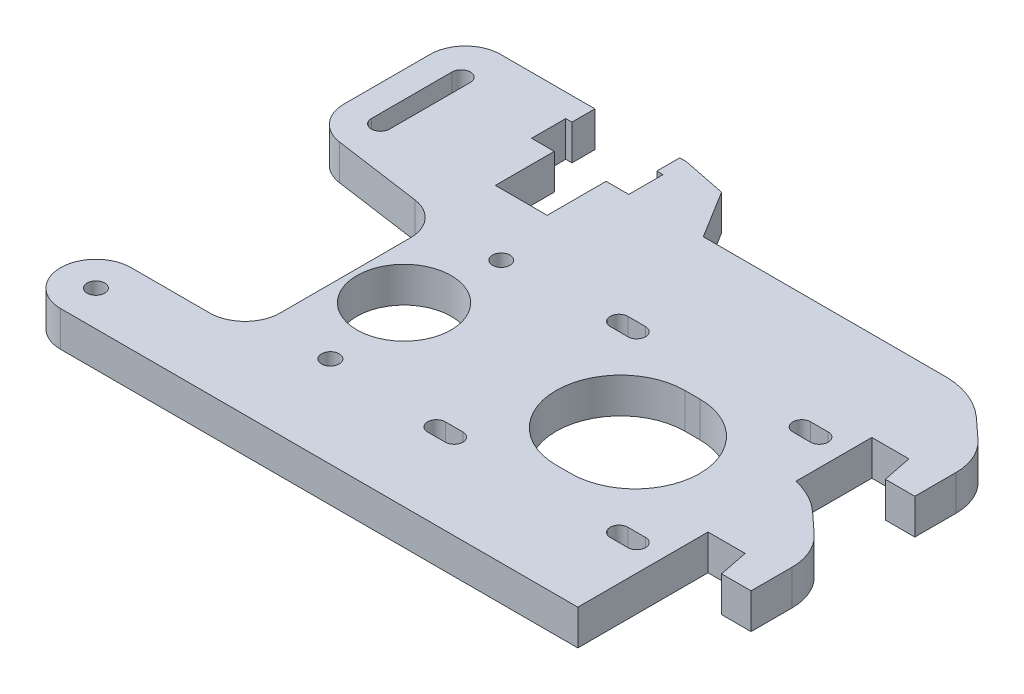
ISO-10303-21;
HEADER;
FILE_DESCRIPTION(('STEP AP214'),'2;1');
FILE_NAME('part.step','',(''),(''),'','','');
FILE_SCHEMA(('AUTOMOTIVE_DESIGN { 1 0 10303 214 1 1 1 1 }'));
ENDSEC;
DATA;
#1=APPLICATION_CONTEXT('core data for automotive mechanical design processes');
#2=APPLICATION_PROTOCOL_DEFINITION('international standard','automotive_design',2000,#1);
#3=PRODUCT_CONTEXT('',#1,'mechanical');
#4=PRODUCT('Part','Part','',(#3));
#5=PRODUCT_RELATED_PRODUCT_CATEGORY('part','',(#4));
#6=PRODUCT_DEFINITION_FORMATION('','',#4);
#7=PRODUCT_DEFINITION_CONTEXT('part definition',#1,'design');
#8=PRODUCT_DEFINITION('design','',#6,#7);
#9=PRODUCT_DEFINITION_SHAPE('','',#8);
#10=(LENGTH_UNIT() NAMED_UNIT(*) SI_UNIT(.MILLI.,.METRE.));
#11=(NAMED_UNIT(*) PLANE_ANGLE_UNIT() SI_UNIT($,.RADIAN.));
#12=(NAMED_UNIT(*) SI_UNIT($,.STERADIAN.) SOLID_ANGLE_UNIT());
#13=UNCERTAINTY_MEASURE_WITH_UNIT(LENGTH_MEASURE(1.E-05),#10,'distance_accuracy_value','');
#14=(GEOMETRIC_REPRESENTATION_CONTEXT(3) GLOBAL_UNCERTAINTY_ASSIGNED_CONTEXT((#13)) GLOBAL_UNIT_ASSIGNED_CONTEXT((#10,
#11,#12)) REPRESENTATION_CONTEXT('',''));
#15=CARTESIAN_POINT('',(0.,0.,0.));
#16=DIRECTION('',(0.,0.,1.));
#17=DIRECTION('',(1.,0.,0.));
#18=AXIS2_PLACEMENT_3D('',#15,#16,#17);
#19=CARTESIAN_POINT('',(-13.55024622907,-3.,-39.50352712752));
#20=DIRECTION('',(0.,0.,-1.));
#21=DIRECTION('',(-1.,0.,0.));
#22=AXIS2_PLACEMENT_3D('',#19,#20,#21);
#23=PLANE('',#22);
#24=DIRECTION('',(0.,1.,0.));
#25=VECTOR('',#24,1.);
#26=CARTESIAN_POINT('',(-13.5502462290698,-3.,-39.5035271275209));
#27=LINE('',#26,#25);
#28=CARTESIAN_POINT('',(-13.55024622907,-3.,-39.5035271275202));
#29=VERTEX_POINT('',#28);
#30=CARTESIAN_POINT('',(-13.55024622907,3.,-39.5035271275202));
#31=VERTEX_POINT('',#30);
#32=EDGE_CURVE('E427',#29,#31,#27,.T.);
#33=ORIENTED_EDGE('',*,*,#32,.F.);
#34=DIRECTION('',(-1.,0.,0.));
#35=VECTOR('',#34,1.);
#36=CARTESIAN_POINT('',(-13.55024622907,-3.,-39.50352712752));
#37=LINE('',#36,#35);
#38=CARTESIAN_POINT('',(-14.65024622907,-3.,-39.50352712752));
#39=VERTEX_POINT('',#38);
#40=EDGE_CURVE('E408',#29,#39,#37,.T.);
#41=ORIENTED_EDGE('',*,*,#40,.T.);
#42=DIRECTION('',(0.,1.,0.));
#43=VECTOR('',#42,1.);
#44=CARTESIAN_POINT('',(-14.65024622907,-3.,-39.50352712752));
#45=LINE('',#44,#43);
#46=CARTESIAN_POINT('',(-14.65024622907,3.,-39.50352712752));
#47=VERTEX_POINT('',#46);
#48=EDGE_CURVE('E800',#47,#39,#45,.F.);
#49=ORIENTED_EDGE('',*,*,#48,.F.);
#50=DIRECTION('',(1.,0.,0.));
#51=VECTOR('',#50,1.);
#52=CARTESIAN_POINT('',(0.,3.,-39.50352712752));
#53=LINE('',#52,#51);
#54=EDGE_CURVE('E331',#31,#47,#53,.F.);
#55=ORIENTED_EDGE('',*,*,#54,.F.);
#56=EDGE_LOOP('',(#33,#41,#49,#55));
#57=FACE_BOUND('',#56,.T.);
#58=ADVANCED_FACE('F17',(#57),#23,.T.);
#59=CARTESIAN_POINT('',(-14.65024622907,-3.,-35.60352712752));
#60=DIRECTION('',(0.,0.,1.));
#61=DIRECTION('',(1.,0.,0.));
#62=AXIS2_PLACEMENT_3D('',#59,#60,#61);
#63=PLANE('',#62);
#64=DIRECTION('',(0.,1.,0.));
#65=VECTOR('',#64,1.);
#66=CARTESIAN_POINT('',(-14.65024622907,-3.,-35.60352712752));
#67=LINE('',#66,#65);
#68=CARTESIAN_POINT('',(-14.65024622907,-3.,-35.60352712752));
#69=VERTEX_POINT('',#68);
#70=CARTESIAN_POINT('',(-14.65024622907,3.,-35.60352712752));
#71=VERTEX_POINT('',#70);
#72=EDGE_CURVE('E432',#69,#71,#67,.T.);
#73=ORIENTED_EDGE('',*,*,#72,.F.);
#74=DIRECTION('',(1.,0.,0.));
#75=VECTOR('',#74,1.);
#76=CARTESIAN_POINT('',(-14.65024622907,-3.,-35.60352712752));
#77=LINE('',#76,#75);
#78=CARTESIAN_POINT('',(-13.60024622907,-3.,-35.60352712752));
#79=VERTEX_POINT('',#78);
#80=EDGE_CURVE('E399',#69,#79,#77,.T.);
#81=ORIENTED_EDGE('',*,*,#80,.T.);
#82=DIRECTION('',(0.,1.,0.));
#83=VECTOR('',#82,1.);
#84=CARTESIAN_POINT('',(-13.60024622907,-3.,-35.60352712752));
#85=LINE('',#84,#83);
#86=CARTESIAN_POINT('',(-13.60024622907,3.,-35.60352712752));
#87=VERTEX_POINT('',#86);
#88=EDGE_CURVE('E806',#87,#79,#85,.F.);
#89=ORIENTED_EDGE('',*,*,#88,.F.);
#90=DIRECTION('',(1.,0.,0.));
#91=VECTOR('',#90,1.);
#92=CARTESIAN_POINT('',(0.,3.,-35.60352712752));
#93=LINE('',#92,#91);
#94=EDGE_CURVE('E328',#71,#87,#93,.T.);
#95=ORIENTED_EDGE('',*,*,#94,.F.);
#96=EDGE_LOOP('',(#73,#81,#89,#95));
#97=FACE_BOUND('',#96,.T.);
#98=ADVANCED_FACE('F1149',(#97),#63,.T.);
#99=CARTESIAN_POINT('',(-30.10024622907,-3.,-35.60352712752));
#100=DIRECTION('',(0.,0.,1.));
#101=DIRECTION('',(1.,0.,0.));
#102=AXIS2_PLACEMENT_3D('',#99,#100,#101);
#103=PLANE('',#102);
#104=DIRECTION('',(0.,1.,0.));
#105=VECTOR('',#104,1.);
#106=CARTESIAN_POINT('',(-30.10024622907,-3.,-35.60352712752));
#107=LINE('',#106,#105);
#108=CARTESIAN_POINT('',(-30.10024622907,-3.,-35.60352712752));
#109=VERTEX_POINT('',#108);
#110=CARTESIAN_POINT('',(-30.10024622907,3.,-35.60352712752));
#111=VERTEX_POINT('',#110);
#112=EDGE_CURVE('E520',#109,#111,#107,.T.);
#113=ORIENTED_EDGE('',*,*,#112,.F.);
#114=DIRECTION('',(1.,0.,0.));
#115=VECTOR('',#114,1.);
#116=CARTESIAN_POINT('',(-30.10024622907,-3.,-35.60352712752));
#117=LINE('',#116,#115);
#118=CARTESIAN_POINT('',(-29.05024622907,-3.,-35.60352712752));
#119=VERTEX_POINT('',#118);
#120=EDGE_CURVE('E334',#109,#119,#117,.T.);
#121=ORIENTED_EDGE('',*,*,#120,.T.);
#122=DIRECTION('',(0.,1.,0.));
#123=VECTOR('',#122,1.);
#124=CARTESIAN_POINT('',(-29.05024622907,-3.,-35.60352712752));
#125=LINE('',#124,#123);
#126=CARTESIAN_POINT('',(-29.05024622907,3.,-35.60352712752));
#127=VERTEX_POINT('',#126);
#128=EDGE_CURVE('E388',#127,#119,#125,.F.);
#129=ORIENTED_EDGE('',*,*,#128,.F.);
#130=DIRECTION('',(1.,0.,0.));
#131=VECTOR('',#130,1.);
#132=CARTESIAN_POINT('',(0.,3.,-35.60352712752));
#133=LINE('',#132,#131);
#134=EDGE_CURVE('E319',#111,#127,#133,.T.);
#135=ORIENTED_EDGE('',*,*,#134,.F.);
#136=EDGE_LOOP('',(#113,#121,#129,#135));
#137=FACE_BOUND('',#136,.T.);
#138=ADVANCED_FACE('F1032',(#137),#103,.T.);
#139=CARTESIAN_POINT('',(0.,3.,0.));
#140=DIRECTION('',(0.,1.,0.));
#141=DIRECTION('',(0.,0.,1.));
#142=AXIS2_PLACEMENT_3D('',#139,#140,#141);
#143=PLANE('',#142);
#144=CARTESIAN_POINT('',(-14.75024622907,3.,19.69647287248));
#145=DIRECTION('',(0.,1.,0.));
#146=DIRECTION('',(0.,0.,1.));
#147=AXIS2_PLACEMENT_3D('',#144,#145,#146);
#148=CIRCLE('',#147,1.5);
#149=CARTESIAN_POINT('',(-14.75024622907,3.,21.19647287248));
#150=VERTEX_POINT('',#149);
#151=EDGE_CURVE('E630',#150,#150,#148,.F.);
#152=ORIENTED_EDGE('',*,*,#151,.T.);
#153=EDGE_LOOP('',(#152));
#154=FACE_BOUND('',#153,.T.);
#155=CARTESIAN_POINT('',(-14.75024622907,3.,-9.303527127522));
#156=DIRECTION('',(0.,1.,0.));
#157=DIRECTION('',(0.,0.,1.));
#158=AXIS2_PLACEMENT_3D('',#155,#156,#157);
#159=CIRCLE('',#158,1.5);
#160=CARTESIAN_POINT('',(-14.75024622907,3.,-7.803527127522));
#161=VERTEX_POINT('',#160);
#162=EDGE_CURVE('E633',#161,#161,#159,.F.);
#163=ORIENTED_EDGE('',*,*,#162,.T.);
#164=EDGE_LOOP('',(#163));
#165=FACE_BOUND('',#164,.T.);
#166=CARTESIAN_POINT('',(-16.75024622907,3.,5.196472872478));
#167=DIRECTION('',(0.,1.,0.));
#168=DIRECTION('',(0.,0.,1.));
#169=AXIS2_PLACEMENT_3D('',#166,#167,#168);
#170=CIRCLE('',#169,8.);
#171=CARTESIAN_POINT('',(-16.75024622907,3.,13.196472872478));
#172=VERTEX_POINT('',#171);
#173=EDGE_CURVE('E636',#172,#172,#170,.F.);
#174=ORIENTED_EDGE('',*,*,#173,.T.);
#175=EDGE_LOOP('',(#174));
#176=FACE_BOUND('',#175,.T.);
#177=CARTESIAN_POINT('',(4.249753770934,3.,-10.30352712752));
#178=DIRECTION('',(0.,1.,0.));
#179=DIRECTION('',(0.,0.,1.));
#180=AXIS2_PLACEMENT_3D('',#177,#178,#179);
#181=CIRCLE('',#180,1.5);
#182=CARTESIAN_POINT('',(4.249753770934,3.,-8.803527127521));
#183=VERTEX_POINT('',#182);
#184=CARTESIAN_POINT('',(4.249753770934,3.,-11.80352712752));
#185=VERTEX_POINT('',#184);
#186=EDGE_CURVE('E640',#183,#185,#181,.F.);
#187=ORIENTED_EDGE('',*,*,#186,.T.);
#188=DIRECTION('',(-1.,0.,0.));
#189=VECTOR('',#188,1.);
#190=CARTESIAN_POINT('',(7.249753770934,3.,-11.80352712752));
#191=LINE('',#190,#189);
#192=CARTESIAN_POINT('',(7.249753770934,3.,-11.80352712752));
#193=VERTEX_POINT('',#192);
#194=EDGE_CURVE('E335',#185,#193,#191,.F.);
#195=ORIENTED_EDGE('',*,*,#194,.T.);
#196=CARTESIAN_POINT('',(7.249753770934,3.,-10.30352712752));
#197=DIRECTION('',(0.,1.,0.));
#198=DIRECTION('',(0.,0.,1.));
#199=AXIS2_PLACEMENT_3D('',#196,#197,#198);
#200=CIRCLE('',#199,1.5);
#201=CARTESIAN_POINT('',(7.249753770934,3.,-8.803527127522));
#202=VERTEX_POINT('',#201);
#203=EDGE_CURVE('E643',#193,#202,#200,.F.);
#204=ORIENTED_EDGE('',*,*,#203,.T.);
#205=DIRECTION('',(1.,0.,0.));
#206=VECTOR('',#205,1.);
#207=CARTESIAN_POINT('',(4.249753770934,3.,-8.803527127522));
#208=LINE('',#207,#206);
#209=EDGE_CURVE('E339',#202,#183,#208,.F.);
#210=ORIENTED_EDGE('',*,*,#209,.T.);
#211=EDGE_LOOP('',(#187,#195,#204,#210));
#212=FACE_BOUND('',#211,.T.);
#213=DIRECTION('',(-1.,0.,0.));
#214=VECTOR('',#213,1.);
#215=CARTESIAN_POINT('',(7.249753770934,3.,19.19647287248));
#216=LINE('',#215,#214);
#217=CARTESIAN_POINT('',(4.249753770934,3.,19.19647287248));
#218=VERTEX_POINT('',#217);
#219=CARTESIAN_POINT('',(7.249753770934,3.,19.19647287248));
#220=VERTEX_POINT('',#219);
#221=EDGE_CURVE('E342',#218,#220,#216,.F.);
#222=ORIENTED_EDGE('',*,*,#221,.T.);
#223=CARTESIAN_POINT('',(7.249753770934,3.,20.69647287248));
#224=DIRECTION('',(0.,1.,0.));
#225=DIRECTION('',(0.,0.,1.));
#226=AXIS2_PLACEMENT_3D('',#223,#224,#225);
#227=CIRCLE('',#226,1.5);
#228=CARTESIAN_POINT('',(7.249753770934,3.,22.19647287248));
#229=VERTEX_POINT('',#228);
#230=EDGE_CURVE('E647',#220,#229,#227,.F.);
#231=ORIENTED_EDGE('',*,*,#230,.T.);
#232=DIRECTION('',(1.,0.,0.));
#233=VECTOR('',#232,1.);
#234=CARTESIAN_POINT('',(4.249753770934,3.,22.19647287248));
#235=LINE('',#234,#233);
#236=CARTESIAN_POINT('',(4.249753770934,3.,22.19647287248));
#237=VERTEX_POINT('',#236);
#238=EDGE_CURVE('E346',#229,#237,#235,.F.);
#239=ORIENTED_EDGE('',*,*,#238,.T.);
#240=CARTESIAN_POINT('',(4.249753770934,3.,20.69647287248));
#241=DIRECTION('',(0.,1.,0.));
#242=DIRECTION('',(0.,0.,1.));
#243=AXIS2_PLACEMENT_3D('',#240,#241,#242);
#244=CIRCLE('',#243,1.5);
#245=EDGE_CURVE('E645',#237,#218,#244,.F.);
#246=ORIENTED_EDGE('',*,*,#245,.T.);
#247=EDGE_LOOP('',(#222,#231,#239,#246));
#248=FACE_BOUND('',#247,.T.);
#249=DIRECTION('',(-1.,0.,0.));
#250=VECTOR('',#249,1.);
#251=CARTESIAN_POINT('',(38.24975377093,3.,19.19647287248));
#252=LINE('',#251,#250);
#253=CARTESIAN_POINT('',(35.24975377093,3.,19.19647287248));
#254=VERTEX_POINT('',#253);
#255=CARTESIAN_POINT('',(38.24975377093,3.,19.19647287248));
#256=VERTEX_POINT('',#255);
#257=EDGE_CURVE('E350',#254,#256,#252,.F.);
#258=ORIENTED_EDGE('',*,*,#257,.T.);
#259=CARTESIAN_POINT('',(38.24975377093,3.,20.69647287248));
#260=DIRECTION('',(0.,1.,0.));
#261=DIRECTION('',(0.,0.,1.));
#262=AXIS2_PLACEMENT_3D('',#259,#260,#261);
#263=CIRCLE('',#262,1.5);
#264=CARTESIAN_POINT('',(38.24975377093,3.,22.19647287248));
#265=VERTEX_POINT('',#264);
#266=EDGE_CURVE('E651',#256,#265,#263,.F.);
#267=ORIENTED_EDGE('',*,*,#266,.T.);
#268=DIRECTION('',(1.,0.,0.));
#269=VECTOR('',#268,1.);
#270=CARTESIAN_POINT('',(35.24975377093,3.,22.19647287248));
#271=LINE('',#270,#269);
#272=CARTESIAN_POINT('',(35.24975377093,3.,22.19647287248));
#273=VERTEX_POINT('',#272);
#274=EDGE_CURVE('E355',#265,#273,#271,.F.);
#275=ORIENTED_EDGE('',*,*,#274,.T.);
#276=CARTESIAN_POINT('',(35.24975377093,3.,20.69647287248));
#277=DIRECTION('',(0.,1.,0.));
#278=DIRECTION('',(0.,0.,1.));
#279=AXIS2_PLACEMENT_3D('',#276,#277,#278);
#280=CIRCLE('',#279,1.5);
#281=EDGE_CURVE('E649',#273,#254,#280,.F.);
#282=ORIENTED_EDGE('',*,*,#281,.T.);
#283=EDGE_LOOP('',(#258,#267,#275,#282));
#284=FACE_BOUND('',#283,.T.);
#285=DIRECTION('',(-1.,0.,0.));
#286=VECTOR('',#285,1.);
#287=CARTESIAN_POINT('',(38.24975377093,3.,-11.80352712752));
#288=LINE('',#287,#286);
#289=CARTESIAN_POINT('',(35.24975377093,3.,-11.80352712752));
#290=VERTEX_POINT('',#289);
#291=CARTESIAN_POINT('',(38.24975377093,3.,-11.80352712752));
#292=VERTEX_POINT('',#291);
#293=EDGE_CURVE('E359',#290,#292,#288,.F.);
#294=ORIENTED_EDGE('',*,*,#293,.T.);
#295=CARTESIAN_POINT('',(38.24975377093,3.,-10.30352712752));
#296=DIRECTION('',(0.,1.,0.));
#297=DIRECTION('',(0.,0.,1.));
#298=AXIS2_PLACEMENT_3D('',#295,#296,#297);
#299=CIRCLE('',#298,1.5);
#300=CARTESIAN_POINT('',(38.24975377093,3.,-8.803527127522));
#301=VERTEX_POINT('',#300);
#302=EDGE_CURVE('E655',#292,#301,#299,.F.);
#303=ORIENTED_EDGE('',*,*,#302,.T.);
#304=DIRECTION('',(1.,0.,0.));
#305=VECTOR('',#304,1.);
#306=CARTESIAN_POINT('',(35.24975377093,3.,-8.803527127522));
#307=LINE('',#306,#305);
#308=CARTESIAN_POINT('',(35.24975377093,3.,-8.803527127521));
#309=VERTEX_POINT('',#308);
#310=EDGE_CURVE('E364',#301,#309,#307,.F.);
#311=ORIENTED_EDGE('',*,*,#310,.T.);
#312=CARTESIAN_POINT('',(35.24975377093,3.,-10.30352712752));
#313=DIRECTION('',(0.,1.,0.));
#314=DIRECTION('',(0.,0.,1.));
#315=AXIS2_PLACEMENT_3D('',#312,#313,#314);
#316=CIRCLE('',#315,1.5);
#317=EDGE_CURVE('E653',#309,#290,#316,.F.);
#318=ORIENTED_EDGE('',*,*,#317,.T.);
#319=EDGE_LOOP('',(#294,#303,#311,#318));
#320=FACE_BOUND('',#319,.T.);
#321=DIRECTION('',(-1.,0.,0.));
#322=VECTOR('',#321,1.);
#323=CARTESIAN_POINT('',(22.49975377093,3.,-5.753527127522));
#324=LINE('',#323,#322);
#325=CARTESIAN_POINT('',(19.99975377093,3.,-5.753527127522));
#326=VERTEX_POINT('',#325);
#327=CARTESIAN_POINT('',(22.49975377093,3.,-5.753527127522));
#328=VERTEX_POINT('',#327);
#329=EDGE_CURVE('E368',#326,#328,#324,.F.);
#330=ORIENTED_EDGE('',*,*,#329,.T.);
#331=CARTESIAN_POINT('',(22.49975377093,3.,5.196472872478));
#332=DIRECTION('',(0.,1.,0.));
#333=DIRECTION('',(0.,0.,1.));
#334=AXIS2_PLACEMENT_3D('',#331,#332,#333);
#335=CIRCLE('',#334,10.95);
#336=CARTESIAN_POINT('',(22.49975377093,3.,16.14647287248));
#337=VERTEX_POINT('',#336);
#338=EDGE_CURVE('E659',#328,#337,#335,.F.);
#339=ORIENTED_EDGE('',*,*,#338,.T.);
#340=DIRECTION('',(1.,0.,0.));
#341=VECTOR('',#340,1.);
#342=CARTESIAN_POINT('',(19.99975377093,3.,16.14647287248));
#343=LINE('',#342,#341);
#344=CARTESIAN_POINT('',(19.99975377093,3.,16.146472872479));
#345=VERTEX_POINT('',#344);
#346=EDGE_CURVE('E373',#337,#345,#343,.F.);
#347=ORIENTED_EDGE('',*,*,#346,.T.);
#348=CARTESIAN_POINT('',(19.99975377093,3.,5.196472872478));
#349=DIRECTION('',(0.,1.,0.));
#350=DIRECTION('',(0.,0.,1.));
#351=AXIS2_PLACEMENT_3D('',#348,#349,#350);
#352=CIRCLE('',#351,10.95);
#353=EDGE_CURVE('E657',#345,#326,#352,.F.);
#354=ORIENTED_EDGE('',*,*,#353,.T.);
#355=EDGE_LOOP('',(#330,#339,#347,#354));
#356=FACE_BOUND('',#355,.T.);
#357=CARTESIAN_POINT('',(-45.05024622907,3.,-32.80352712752));
#358=DIRECTION('',(0.,1.,0.));
#359=DIRECTION('',(0.,0.,1.));
#360=AXIS2_PLACEMENT_3D('',#357,#358,#359);
#361=CIRCLE('',#360,1.55);
#362=CARTESIAN_POINT('',(-46.60024622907,3.,-32.80352712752));
#363=VERTEX_POINT('',#362);
#364=CARTESIAN_POINT('',(-43.50024622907,3.,-32.80352712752));
#365=VERTEX_POINT('',#364);
#366=EDGE_CURVE('E662',#363,#365,#361,.F.);
#367=ORIENTED_EDGE('',*,*,#366,.T.);
#368=DIRECTION('',(0.,0.,1.));
#369=VECTOR('',#368,1.);
#370=CARTESIAN_POINT('',(-43.50024622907,3.,-32.80352712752));
#371=LINE('',#370,#369);
#372=CARTESIAN_POINT('',(-43.50024622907,3.,-19.10352712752));
#373=VERTEX_POINT('',#372);
#374=EDGE_CURVE('E377',#373,#365,#371,.F.);
#375=ORIENTED_EDGE('',*,*,#374,.F.);
#376=CARTESIAN_POINT('',(-45.05024622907,3.,-19.10352712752));
#377=DIRECTION('',(0.,1.,0.));
#378=DIRECTION('',(0.,0.,1.));
#379=AXIS2_PLACEMENT_3D('',#376,#377,#378);
#380=CIRCLE('',#379,1.55);
#381=CARTESIAN_POINT('',(-46.60024622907,3.,-19.10352712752));
#382=VERTEX_POINT('',#381);
#383=EDGE_CURVE('E384',#373,#382,#380,.F.);
#384=ORIENTED_EDGE('',*,*,#383,.T.);
#385=DIRECTION('',(0.,0.,-1.));
#386=VECTOR('',#385,1.);
#387=CARTESIAN_POINT('',(-46.60024622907,3.,-19.10352712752));
#388=LINE('',#387,#386);
#389=EDGE_CURVE('E381',#363,#382,#388,.F.);
#390=ORIENTED_EDGE('',*,*,#389,.F.);
#391=EDGE_LOOP('',(#367,#375,#384,#390));
#392=FACE_BOUND('',#391,.T.);
#393=CARTESIAN_POINT('',(-45.05024622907,3.,29.19647287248));
#394=DIRECTION('',(0.,1.,0.));
#395=DIRECTION('',(0.,0.,1.));
#396=AXIS2_PLACEMENT_3D('',#393,#394,#395);
#397=CIRCLE('',#396,1.5);
#398=CARTESIAN_POINT('',(-45.05024622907,3.,30.69647287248));
#399=VERTEX_POINT('',#398);
#400=EDGE_CURVE('E380',#399,#399,#397,.F.);
#401=ORIENTED_EDGE('',*,*,#400,.T.);
#402=EDGE_LOOP('',(#401));
#403=FACE_BOUND('',#402,.T.);
#404=DIRECTION('',(-1.,0.,0.));
#405=VECTOR('',#404,1.);
#406=CARTESIAN_POINT('',(-29.05024622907,3.,-39.50352712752));
#407=LINE('',#406,#405);
#408=CARTESIAN_POINT('',(-45.05024622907,3.,-39.50352712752));
#409=VERTEX_POINT('',#408);
#410=CARTESIAN_POINT('',(-29.05024622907,3.,-39.50352712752));
#411=VERTEX_POINT('',#410);
#412=EDGE_CURVE('E315',#409,#411,#407,.F.);
#413=ORIENTED_EDGE('',*,*,#412,.F.);
#414=CARTESIAN_POINT('',(-45.05024622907,3.,-33.50352712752));
#415=DIRECTION('',(0.,1.,0.));
#416=DIRECTION('',(0.,0.,1.));
#417=AXIS2_PLACEMENT_3D('',#414,#415,#416);
#418=CIRCLE('',#417,6.);
#419=CARTESIAN_POINT('',(-51.05024622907,3.,-33.50352712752));
#420=VERTEX_POINT('',#419);
#421=EDGE_CURVE('E20',#420,#409,#418,.F.);
#422=ORIENTED_EDGE('',*,*,#421,.F.);
#423=DIRECTION('',(0.,0.,1.));
#424=VECTOR('',#423,1.);
#425=CARTESIAN_POINT('',(-51.05024622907,3.,-33.50352712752));
#426=LINE('',#425,#424);
#427=CARTESIAN_POINT('',(-51.05024622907,3.,-18.90352712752));
#428=VERTEX_POINT('',#427);
#429=EDGE_CURVE('E299',#428,#420,#426,.F.);
#430=ORIENTED_EDGE('',*,*,#429,.F.);
#431=CARTESIAN_POINT('',(-45.05024622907,3.,-18.90352712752));
#432=DIRECTION('',(0.,1.,0.));
#433=DIRECTION('',(0.,0.,1.));
#434=AXIS2_PLACEMENT_3D('',#431,#432,#433);
#435=CIRCLE('',#434,6.);
#436=CARTESIAN_POINT('',(-45.8902937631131,3.,-12.9626248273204));
#437=VERTEX_POINT('',#436);
#438=EDGE_CURVE('E323',#437,#428,#435,.F.);
#439=ORIENTED_EDGE('',*,*,#438,.F.);
#440=DIRECTION('',(0.990150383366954,0.,0.140007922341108));
#441=VECTOR('',#440,1.);
#442=CARTESIAN_POINT('',(-45.89029376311,3.,-12.96262482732));
#443=LINE('',#442,#441);
#444=CARTESIAN_POINT('',(-30.9101986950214,3.,-10.8444294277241));
#445=VERTEX_POINT('',#444);
#446=EDGE_CURVE('E517',#445,#437,#443,.F.);
#447=ORIENTED_EDGE('',*,*,#446,.F.);
#448=CARTESIAN_POINT('',(-31.75024622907,3.,-4.903527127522));
#449=DIRECTION('',(0.,1.,0.));
#450=DIRECTION('',(0.,0.,1.));
#451=AXIS2_PLACEMENT_3D('',#448,#449,#450);
#452=CIRCLE('',#451,6.);
#453=CARTESIAN_POINT('',(-25.75024622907,3.,-4.903527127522));
#454=VERTEX_POINT('',#453);
#455=EDGE_CURVE('E516',#445,#454,#452,.F.);
#456=ORIENTED_EDGE('',*,*,#455,.T.);
#457=DIRECTION('',(0.,0.,1.));
#458=VECTOR('',#457,1.);
#459=CARTESIAN_POINT('',(-25.75024622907,3.,-4.903527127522));
#460=LINE('',#459,#458);
#461=CARTESIAN_POINT('',(-25.75024622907,3.,17.19647287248));
#462=VERTEX_POINT('',#461);
#463=EDGE_CURVE('E513',#462,#454,#460,.F.);
#464=ORIENTED_EDGE('',*,*,#463,.F.);
#465=CARTESIAN_POINT('',(-31.75024622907,3.,17.19647287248));
#466=DIRECTION('',(0.,1.,0.));
#467=DIRECTION('',(0.,0.,1.));
#468=AXIS2_PLACEMENT_3D('',#465,#466,#467);
#469=CIRCLE('',#468,6.);
#470=CARTESIAN_POINT('',(-31.75024622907,3.,23.19647287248));
#471=VERTEX_POINT('',#470);
#472=EDGE_CURVE('E512',#462,#471,#469,.F.);
#473=ORIENTED_EDGE('',*,*,#472,.T.);
#474=DIRECTION('',(-1.,0.,0.));
#475=VECTOR('',#474,1.);
#476=CARTESIAN_POINT('',(-31.75024622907,3.,23.19647287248));
#477=LINE('',#476,#475);
#478=CARTESIAN_POINT('',(-45.05024622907,3.,23.19647287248));
#479=VERTEX_POINT('',#478);
#480=EDGE_CURVE('E509',#479,#471,#477,.F.);
#481=ORIENTED_EDGE('',*,*,#480,.F.);
#482=CARTESIAN_POINT('',(-45.05024622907,3.,29.19647287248));
#483=DIRECTION('',(0.,1.,0.));
#484=DIRECTION('',(0.,0.,1.));
#485=AXIS2_PLACEMENT_3D('',#482,#483,#484);
#486=CIRCLE('',#485,6.);
#487=CARTESIAN_POINT('',(-45.05024622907,3.,35.19647287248));
#488=VERTEX_POINT('',#487);
#489=EDGE_CURVE('E678',#488,#479,#486,.F.);
#490=ORIENTED_EDGE('',*,*,#489,.F.);
#491=DIRECTION('',(1.,0.,0.));
#492=VECTOR('',#491,1.);
#493=CARTESIAN_POINT('',(-45.05024622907,3.,35.19647287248));
#494=LINE('',#493,#492);
#495=CARTESIAN_POINT('',(42.74975377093,3.,35.19647287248));
#496=VERTEX_POINT('',#495);
#497=EDGE_CURVE('E504',#496,#488,#494,.F.);
#498=ORIENTED_EDGE('',*,*,#497,.F.);
#499=DIRECTION('',(0.,0.,-1.));
#500=VECTOR('',#499,1.);
#501=CARTESIAN_POINT('',(42.74975377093,3.,35.19647287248));
#502=LINE('',#501,#500);
#503=CARTESIAN_POINT('',(42.74975377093,3.,13.09647287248));
#504=VERTEX_POINT('',#503);
#505=EDGE_CURVE('E498',#504,#496,#502,.F.);
#506=ORIENTED_EDGE('',*,*,#505,.F.);
#507=DIRECTION('',(1.,0.,0.));
#508=VECTOR('',#507,1.);
#509=CARTESIAN_POINT('',(42.74975377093,3.,13.09647287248));
#510=LINE('',#509,#508);
#511=CARTESIAN_POINT('',(49.05065518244,3.,13.09647287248));
#512=VERTEX_POINT('',#511);
#513=EDGE_CURVE('E492',#512,#504,#510,.F.);
#514=ORIENTED_EDGE('',*,*,#513,.F.);
#515=DIRECTION('',(0.195946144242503,0.,0.980614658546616));
#516=VECTOR('',#515,1.);
#517=CARTESIAN_POINT('',(49.05065518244,3.,13.09647287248));
#518=LINE('',#517,#516);
#519=CARTESIAN_POINT('',(50.049753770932,3.,18.0964728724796));
#520=VERTEX_POINT('',#519);
#521=EDGE_CURVE('E486',#520,#512,#518,.F.);
#522=ORIENTED_EDGE('',*,*,#521,.F.);
#523=DIRECTION('',(1.,0.,0.));
#524=VECTOR('',#523,1.);
#525=CARTESIAN_POINT('',(50.04975377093,3.,18.09647287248));
#526=LINE('',#525,#524);
#527=CARTESIAN_POINT('',(55.04975377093,3.,18.09647287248));
#528=VERTEX_POINT('',#527);
#529=EDGE_CURVE('E480',#528,#520,#526,.F.);
#530=ORIENTED_EDGE('',*,*,#529,.F.);
#531=DIRECTION('',(0.,0.,-1.));
#532=VECTOR('',#531,1.);
#533=CARTESIAN_POINT('',(55.04975377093,3.,18.09647287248));
#534=LINE('',#533,#532);
#535=CARTESIAN_POINT('',(55.04975377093,3.,11.1311417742));
#536=VERTEX_POINT('',#535);
#537=EDGE_CURVE('E473',#536,#528,#534,.F.);
#538=ORIENTED_EDGE('',*,*,#537,.F.);
#539=CARTESIAN_POINT('',(45.94975377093,3.,11.1311417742));
#540=DIRECTION('',(0.,1.,0.));
#541=DIRECTION('',(0.,0.,1.));
#542=AXIS2_PLACEMENT_3D('',#539,#540,#541);
#543=CIRCLE('',#542,9.1);
#544=CARTESIAN_POINT('',(52.1093250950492,3.,4.43265828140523));
#545=VERTEX_POINT('',#544);
#546=EDGE_CURVE('E676',#545,#536,#543,.F.);
#547=ORIENTED_EDGE('',*,*,#546,.F.);
#548=DIRECTION('',(-0.736097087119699,0.,-0.676875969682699));
#549=VECTOR('',#548,1.);
#550=CARTESIAN_POINT('',(52.10932509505,3.,4.432658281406));
#551=LINE('',#550,#549);
#552=CARTESIAN_POINT('',(48.6460785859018,3.,1.24803986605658));
#553=VERTEX_POINT('',#552);
#554=EDGE_CURVE('E469',#553,#545,#551,.F.);
#555=ORIENTED_EDGE('',*,*,#554,.F.);
#556=CARTESIAN_POINT('',(40.04975377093,3.,10.59647287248));
#557=DIRECTION('',(0.,1.,0.));
#558=DIRECTION('',(0.,0.,1.));
#559=AXIS2_PLACEMENT_3D('',#556,#557,#558);
#560=CIRCLE('',#559,12.7);
#561=CARTESIAN_POINT('',(42.74975377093,3.,-1.81320077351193));
#562=VERTEX_POINT('',#561);
#563=EDGE_CURVE('E674',#562,#553,#560,.F.);
#564=ORIENTED_EDGE('',*,*,#563,.F.);
#565=DIRECTION('',(0.,0.,-1.));
#566=VECTOR('',#565,1.);
#567=CARTESIAN_POINT('',(42.74975377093,3.,-1.813200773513));
#568=LINE('',#567,#566);
#569=CARTESIAN_POINT('',(42.74975377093,3.,-14.70352712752));
#570=VERTEX_POINT('',#569);
#571=EDGE_CURVE('E464',#570,#562,#568,.F.);
#572=ORIENTED_EDGE('',*,*,#571,.F.);
#573=DIRECTION('',(1.,0.,0.));
#574=VECTOR('',#573,1.);
#575=CARTESIAN_POINT('',(42.74975377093,3.,-14.70352712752));
#576=LINE('',#575,#574);
#577=CARTESIAN_POINT('',(49.05065518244,3.,-14.70352712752));
#578=VERTEX_POINT('',#577);
#579=EDGE_CURVE('E458',#578,#570,#576,.F.);
#580=ORIENTED_EDGE('',*,*,#579,.F.);
#581=DIRECTION('',(0.195946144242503,0.,0.980614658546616));
#582=VECTOR('',#581,1.);
#583=CARTESIAN_POINT('',(49.05065518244,3.,-14.70352712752));
#584=LINE('',#583,#582);
#585=CARTESIAN_POINT('',(50.0497537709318,3.,-9.70352712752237));
#586=VERTEX_POINT('',#585);
#587=EDGE_CURVE('E452',#586,#578,#584,.F.);
#588=ORIENTED_EDGE('',*,*,#587,.F.);
#589=DIRECTION('',(1.,0.,0.));
#590=VECTOR('',#589,1.);
#591=CARTESIAN_POINT('',(50.04975377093,3.,-9.703527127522));
#592=LINE('',#591,#590);
#593=CARTESIAN_POINT('',(55.04975377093,3.,-9.703527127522));
#594=VERTEX_POINT('',#593);
#595=EDGE_CURVE('E446',#594,#586,#592,.F.);
#596=ORIENTED_EDGE('',*,*,#595,.F.);
#597=DIRECTION('',(0.,0.,-1.));
#598=VECTOR('',#597,1.);
#599=CARTESIAN_POINT('',(55.04975377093,3.,-9.703527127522));
#600=LINE('',#599,#598);
#601=CARTESIAN_POINT('',(55.04975377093,3.,-16.6688582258));
#602=VERTEX_POINT('',#601);
#603=EDGE_CURVE('E439',#602,#594,#600,.F.);
#604=ORIENTED_EDGE('',*,*,#603,.F.);
#605=CARTESIAN_POINT('',(45.94975377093,3.,-16.6688582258));
#606=DIRECTION('',(0.,1.,0.));
#607=DIRECTION('',(0.,0.,1.));
#608=AXIS2_PLACEMENT_3D('',#605,#606,#607);
#609=CIRCLE('',#608,9.1);
#610=CARTESIAN_POINT('',(52.1093250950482,3.,-23.3673417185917));
#611=VERTEX_POINT('',#610);
#612=EDGE_CURVE('E672',#611,#602,#609,.F.);
#613=ORIENTED_EDGE('',*,*,#612,.F.);
#614=DIRECTION('',(-0.736097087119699,0.,-0.676875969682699));
#615=VECTOR('',#614,1.);
#616=CARTESIAN_POINT('',(52.10932509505,3.,-23.36734171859));
#617=LINE('',#616,#615);
#618=CARTESIAN_POINT('',(48.6460785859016,3.,-26.5519601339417));
#619=VERTEX_POINT('',#618);
#620=EDGE_CURVE('E435',#619,#611,#617,.F.);
#621=ORIENTED_EDGE('',*,*,#620,.F.);
#622=CARTESIAN_POINT('',(40.04975377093,3.,-17.20352712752));
#623=DIRECTION('',(0.,1.,0.));
#624=DIRECTION('',(0.,0.,1.));
#625=AXIS2_PLACEMENT_3D('',#622,#623,#624);
#626=CIRCLE('',#625,12.7);
#627=CARTESIAN_POINT('',(40.04975377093,3.,-29.90352712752));
#628=VERTEX_POINT('',#627);
#629=EDGE_CURVE('E670',#628,#619,#626,.F.);
#630=ORIENTED_EDGE('',*,*,#629,.F.);
#631=DIRECTION('',(-1.,0.,0.));
#632=VECTOR('',#631,1.);
#633=CARTESIAN_POINT('',(40.04975377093,3.,-29.90352712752));
#634=LINE('',#633,#632);
#635=CARTESIAN_POINT('',(-1.050246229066,3.,-29.90352712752));
#636=VERTEX_POINT('',#635);
#637=EDGE_CURVE('E411',#636,#628,#634,.F.);
#638=ORIENTED_EDGE('',*,*,#637,.F.);
#639=DIRECTION('',(-0.525269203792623,0.,-0.850936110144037));
#640=VECTOR('',#639,1.);
#641=CARTESIAN_POINT('',(-1.050246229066,3.,-29.90352712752));
#642=LINE('',#641,#640);
#643=CARTESIAN_POINT('',(-6.05024622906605,3.,-38.00352712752));
#644=VERTEX_POINT('',#643);
#645=EDGE_CURVE('E417',#644,#636,#642,.F.);
#646=ORIENTED_EDGE('',*,*,#645,.F.);
#647=DIRECTION('',(-0.980580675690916,0.,-0.196116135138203));
#648=VECTOR('',#647,1.);
#649=CARTESIAN_POINT('',(-6.050246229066,3.,-38.00352712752));
#650=LINE('',#649,#648);
#651=EDGE_CURVE('E423',#31,#644,#650,.F.);
#652=ORIENTED_EDGE('',*,*,#651,.F.);
#653=ORIENTED_EDGE('',*,*,#54,.T.);
#654=DIRECTION('',(0.,0.,1.));
#655=VECTOR('',#654,1.);
#656=CARTESIAN_POINT('',(-14.65024622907,3.,-39.50352712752));
#657=LINE('',#656,#655);
#658=EDGE_CURVE('E797',#71,#47,#657,.F.);
#659=ORIENTED_EDGE('',*,*,#658,.F.);
#660=ORIENTED_EDGE('',*,*,#94,.T.);
#661=DIRECTION('',(0.,0.,1.));
#662=VECTOR('',#661,1.);
#663=CARTESIAN_POINT('',(-13.60024622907,3.,-35.60352712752));
#664=LINE('',#663,#662);
#665=CARTESIAN_POINT('',(-13.60024622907,3.,-29.80352712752));
#666=VERTEX_POINT('',#665);
#667=EDGE_CURVE('E803',#666,#87,#664,.F.);
#668=ORIENTED_EDGE('',*,*,#667,.F.);
#669=DIRECTION('',(-1.,0.,0.));
#670=VECTOR('',#669,1.);
#671=CARTESIAN_POINT('',(-13.60024622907,3.,-29.80352712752));
#672=LINE('',#671,#670);
#673=CARTESIAN_POINT('',(-17.45024622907,3.,-29.80352712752));
#674=VERTEX_POINT('',#673);
#675=EDGE_CURVE('E809',#674,#666,#672,.F.);
#676=ORIENTED_EDGE('',*,*,#675,.F.);
#677=DIRECTION('',(0.,0.,1.));
#678=VECTOR('',#677,1.);
#679=CARTESIAN_POINT('',(-17.45024622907,3.,-29.80352712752));
#680=LINE('',#679,#678);
#681=CARTESIAN_POINT('',(-17.45024622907,3.,-19.80352712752));
#682=VERTEX_POINT('',#681);
#683=EDGE_CURVE('E815',#682,#674,#680,.F.);
#684=ORIENTED_EDGE('',*,*,#683,.F.);
#685=DIRECTION('',(-1.,0.,0.));
#686=VECTOR('',#685,1.);
#687=CARTESIAN_POINT('',(-17.45024622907,3.,-19.80352712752));
#688=LINE('',#687,#686);
#689=CARTESIAN_POINT('',(-26.25024622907,3.,-19.80352712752));
#690=VERTEX_POINT('',#689);
#691=EDGE_CURVE('E821',#690,#682,#688,.F.);
#692=ORIENTED_EDGE('',*,*,#691,.F.);
#693=DIRECTION('',(0.,0.,-1.));
#694=VECTOR('',#693,1.);
#695=CARTESIAN_POINT('',(-26.25024622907,3.,-19.80352712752));
#696=LINE('',#695,#694);
#697=CARTESIAN_POINT('',(-26.25024622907,3.,-29.80352712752));
#698=VERTEX_POINT('',#697);
#699=EDGE_CURVE('E827',#698,#690,#696,.F.);
#700=ORIENTED_EDGE('',*,*,#699,.F.);
#701=DIRECTION('',(-1.,0.,0.));
#702=VECTOR('',#701,1.);
#703=CARTESIAN_POINT('',(-26.25024622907,3.,-29.80352712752));
#704=LINE('',#703,#702);
#705=CARTESIAN_POINT('',(-30.10024622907,3.,-29.80352712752));
#706=VERTEX_POINT('',#705);
#707=EDGE_CURVE('E833',#706,#698,#704,.F.);
#708=ORIENTED_EDGE('',*,*,#707,.F.);
#709=DIRECTION('',(0.,0.,-1.));
#710=VECTOR('',#709,1.);
#711=CARTESIAN_POINT('',(-30.10024622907,3.,-29.80352712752));
#712=LINE('',#711,#710);
#713=EDGE_CURVE('E523',#111,#706,#712,.F.);
#714=ORIENTED_EDGE('',*,*,#713,.F.);
#715=ORIENTED_EDGE('',*,*,#134,.T.);
#716=DIRECTION('',(0.,0.,-1.));
#717=VECTOR('',#716,1.);
#718=CARTESIAN_POINT('',(-29.05024622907,3.,-35.60352712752));
#719=LINE('',#718,#717);
#720=EDGE_CURVE('E385',#411,#127,#719,.F.);
#721=ORIENTED_EDGE('',*,*,#720,.F.);
#722=EDGE_LOOP('',(#413,#422,#430,#439,#447,#456,#464,#473,#481,#490,#498,#506,#514,#522,#530,
#538,#547,#555,#564,#572,#580,#588,#596,#604,#613,#621,#630,#638,#646,#652,#653,#659,#660,#668,
#676,#684,#692,#700,#708,#714,#715,#721));
#723=FACE_BOUND('',#722,.T.);
#724=ADVANCED_FACE('F312',(#154,#165,#176,#212,#248,#284,#320,#356,#392,#403,#723),#143,.T.);
#725=CARTESIAN_POINT('',(-45.05024622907,-3.,-33.50352712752));
#726=DIRECTION('',(0.,1.,0.));
#727=DIRECTION('',(0.,0.,1.));
#728=AXIS2_PLACEMENT_3D('',#725,#726,#727);
#729=CYLINDRICAL_SURFACE('',#728,6.);
#730=DIRECTION('',(0.,1.,0.));
#731=VECTOR('',#730,1.);
#732=CARTESIAN_POINT('',(-45.05024622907,-3.,-39.50352712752));
#733=LINE('',#732,#731);
#734=CARTESIAN_POINT('',(-45.05024622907,-3.,-39.50352712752));
#735=VERTEX_POINT('',#734);
#736=EDGE_CURVE('E394',#735,#409,#733,.T.);
#737=ORIENTED_EDGE('',*,*,#736,.F.);
#738=CARTESIAN_POINT('',(-45.05024622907,-3.,-33.50352712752));
#739=DIRECTION('',(0.,1.,0.));
#740=DIRECTION('',(0.,0.,1.));
#741=AXIS2_PLACEMENT_3D('',#738,#739,#740);
#742=CIRCLE('',#741,6.);
#743=CARTESIAN_POINT('',(-51.05024622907,-3.,-33.50352712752));
#744=VERTEX_POINT('',#743);
#745=EDGE_CURVE('E322',#735,#744,#742,.T.);
#746=ORIENTED_EDGE('',*,*,#745,.T.);
#747=DIRECTION('',(0.,1.,0.));
#748=VECTOR('',#747,1.);
#749=CARTESIAN_POINT('',(-51.05024622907,-3.,-33.50352712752));
#750=LINE('',#749,#748);
#751=EDGE_CURVE('E304',#420,#744,#750,.F.);
#752=ORIENTED_EDGE('',*,*,#751,.F.);
#753=ORIENTED_EDGE('',*,*,#421,.T.);
#754=EDGE_LOOP('',(#737,#746,#752,#753));
#755=FACE_BOUND('',#754,.T.);
#756=ADVANCED_FACE('F321',(#755),#729,.T.);
#757=CARTESIAN_POINT('',(-51.05024622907,-3.,-33.50352712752));
#758=DIRECTION('',(-1.,0.,0.));
#759=DIRECTION('',(0.,0.,1.));
#760=AXIS2_PLACEMENT_3D('',#757,#758,#759);
#761=PLANE('',#760);
#762=ORIENTED_EDGE('',*,*,#751,.T.);
#763=DIRECTION('',(0.,0.,1.));
#764=VECTOR('',#763,1.);
#765=CARTESIAN_POINT('',(-51.05024622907,-3.,0.));
#766=LINE('',#765,#764);
#767=CARTESIAN_POINT('',(-51.05024622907,-3.,-18.90352712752));
#768=VERTEX_POINT('',#767);
#769=EDGE_CURVE('E628',#744,#768,#766,.T.);
#770=ORIENTED_EDGE('',*,*,#769,.T.);
#771=DIRECTION('',(0.,1.,0.));
#772=VECTOR('',#771,1.);
#773=CARTESIAN_POINT('',(-51.05024622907,-3.,-18.90352712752));
#774=LINE('',#773,#772);
#775=EDGE_CURVE('E306',#428,#768,#774,.F.);
#776=ORIENTED_EDGE('',*,*,#775,.F.);
#777=ORIENTED_EDGE('',*,*,#429,.T.);
#778=EDGE_LOOP('',(#762,#770,#776,#777));
#779=FACE_BOUND('',#778,.T.);
#780=ADVANCED_FACE('F301',(#779),#761,.T.);
#781=CARTESIAN_POINT('',(-45.05024622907,-3.,-18.90352712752));
#782=DIRECTION('',(0.,1.,0.));
#783=DIRECTION('',(0.,0.,1.));
#784=AXIS2_PLACEMENT_3D('',#781,#782,#783);
#785=CYLINDRICAL_SURFACE('',#784,6.);
#786=ORIENTED_EDGE('',*,*,#775,.T.);
#787=CARTESIAN_POINT('',(-45.05024622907,-3.,-18.90352712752));
#788=DIRECTION('',(0.,1.,0.));
#789=DIRECTION('',(0.,0.,1.));
#790=AXIS2_PLACEMENT_3D('',#787,#788,#789);
#791=CIRCLE('',#790,6.);
#792=CARTESIAN_POINT('',(-45.890293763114,-3.,-12.9626248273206));
#793=VERTEX_POINT('',#792);
#794=EDGE_CURVE('E625',#768,#793,#791,.T.);
#795=ORIENTED_EDGE('',*,*,#794,.T.);
#796=DIRECTION('',(0.,1.,0.));
#797=VECTOR('',#796,1.);
#798=CARTESIAN_POINT('',(-45.89029376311,-3.,-12.96262482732));
#799=LINE('',#798,#797);
#800=EDGE_CURVE('E518',#437,#793,#799,.F.);
#801=ORIENTED_EDGE('',*,*,#800,.F.);
#802=ORIENTED_EDGE('',*,*,#438,.T.);
#803=EDGE_LOOP('',(#786,#795,#801,#802));
#804=FACE_BOUND('',#803,.T.);
#805=ADVANCED_FACE('F1283',(#804),#785,.T.);
#806=CARTESIAN_POINT('',(-45.89029376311,-3.,-12.96262482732));
#807=DIRECTION('',(-0.140007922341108,0.,0.990150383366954));
#808=DIRECTION('',(0.990150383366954,0.,0.140007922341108));
#809=AXIS2_PLACEMENT_3D('',#806,#807,#808);
#810=PLANE('',#809);
#811=ORIENTED_EDGE('',*,*,#800,.T.);
#812=DIRECTION('',(0.990150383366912,0.,0.140007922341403));
#813=VECTOR('',#812,1.);
#814=CARTESIAN_POINT('',(-45.89029376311,-3.,-12.96262482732));
#815=LINE('',#814,#813);
#816=CARTESIAN_POINT('',(-30.9101986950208,-3.,-10.8444294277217));
#817=VERTEX_POINT('',#816);
#818=EDGE_CURVE('E624',#793,#817,#815,.T.);
#819=ORIENTED_EDGE('',*,*,#818,.T.);
#820=DIRECTION('',(0.,1.,0.));
#821=VECTOR('',#820,1.);
#822=CARTESIAN_POINT('',(-30.9101986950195,-3.,-10.8444294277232));
#823=LINE('',#822,#821);
#824=EDGE_CURVE('E684',#817,#445,#823,.T.);
#825=ORIENTED_EDGE('',*,*,#824,.T.);
#826=ORIENTED_EDGE('',*,*,#446,.T.);
#827=EDGE_LOOP('',(#811,#819,#825,#826));
#828=FACE_BOUND('',#827,.T.);
#829=ADVANCED_FACE('F1280',(#828),#810,.T.);
#830=CARTESIAN_POINT('',(-31.75024622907,-3.,-4.903527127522));
#831=DIRECTION('',(0.,1.,0.));
#832=DIRECTION('',(0.,0.,1.));
#833=AXIS2_PLACEMENT_3D('',#830,#831,#832);
#834=CYLINDRICAL_SURFACE('',#833,6.);
#835=ORIENTED_EDGE('',*,*,#455,.F.);
#836=ORIENTED_EDGE('',*,*,#824,.F.);
#837=CARTESIAN_POINT('',(-31.75024622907,-3.,-4.903527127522));
#838=DIRECTION('',(0.,1.,0.));
#839=DIRECTION('',(0.,0.,1.));
#840=AXIS2_PLACEMENT_3D('',#837,#838,#839);
#841=CIRCLE('',#840,6.);
#842=CARTESIAN_POINT('',(-25.75024622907,-3.,-4.903527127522));
#843=VERTEX_POINT('',#842);
#844=EDGE_CURVE('E621',#817,#843,#841,.F.);
#845=ORIENTED_EDGE('',*,*,#844,.T.);
#846=DIRECTION('',(0.,1.,0.));
#847=VECTOR('',#846,1.);
#848=CARTESIAN_POINT('',(-25.75024622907,-3.,-4.903527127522));
#849=LINE('',#848,#847);
#850=EDGE_CURVE('E515',#454,#843,#849,.F.);
#851=ORIENTED_EDGE('',*,*,#850,.F.);
#852=EDGE_LOOP('',(#835,#836,#845,#851));
#853=FACE_BOUND('',#852,.T.);
#854=ADVANCED_FACE('F1277',(#853),#834,.F.);
#855=CARTESIAN_POINT('',(-25.75024622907,-3.,-4.903527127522));
#856=DIRECTION('',(-1.,0.,0.));
#857=DIRECTION('',(0.,0.,1.));
#858=AXIS2_PLACEMENT_3D('',#855,#856,#857);
#859=PLANE('',#858);
#860=ORIENTED_EDGE('',*,*,#850,.T.);
#861=DIRECTION('',(0.,0.,1.));
#862=VECTOR('',#861,1.);
#863=CARTESIAN_POINT('',(-25.75024622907,-3.,0.));
#864=LINE('',#863,#862);
#865=CARTESIAN_POINT('',(-25.75024622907,-3.,17.19647287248));
#866=VERTEX_POINT('',#865);
#867=EDGE_CURVE('E620',#843,#866,#864,.T.);
#868=ORIENTED_EDGE('',*,*,#867,.T.);
#869=DIRECTION('',(0.,1.,0.));
#870=VECTOR('',#869,1.);
#871=CARTESIAN_POINT('',(-25.75024622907,-3.,17.19647287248));
#872=LINE('',#871,#870);
#873=EDGE_CURVE('E682',#866,#462,#872,.T.);
#874=ORIENTED_EDGE('',*,*,#873,.T.);
#875=ORIENTED_EDGE('',*,*,#463,.T.);
#876=EDGE_LOOP('',(#860,#868,#874,#875));
#877=FACE_BOUND('',#876,.T.);
#878=ADVANCED_FACE('F1275',(#877),#859,.T.);
#879=CARTESIAN_POINT('',(-31.75024622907,-3.,17.19647287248));
#880=DIRECTION('',(0.,1.,0.));
#881=DIRECTION('',(0.,0.,1.));
#882=AXIS2_PLACEMENT_3D('',#879,#880,#881);
#883=CYLINDRICAL_SURFACE('',#882,6.);
#884=ORIENTED_EDGE('',*,*,#472,.F.);
#885=ORIENTED_EDGE('',*,*,#873,.F.);
#886=CARTESIAN_POINT('',(-31.75024622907,-3.,17.19647287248));
#887=DIRECTION('',(0.,1.,0.));
#888=DIRECTION('',(0.,0.,1.));
#889=AXIS2_PLACEMENT_3D('',#886,#887,#888);
#890=CIRCLE('',#889,6.);
#891=CARTESIAN_POINT('',(-31.75024622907,-3.,23.19647287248));
#892=VERTEX_POINT('',#891);
#893=EDGE_CURVE('E617',#866,#892,#890,.F.);
#894=ORIENTED_EDGE('',*,*,#893,.T.);
#895=DIRECTION('',(0.,1.,0.));
#896=VECTOR('',#895,1.);
#897=CARTESIAN_POINT('',(-31.75024622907,-3.,23.19647287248));
#898=LINE('',#897,#896);
#899=EDGE_CURVE('E511',#471,#892,#898,.F.);
#900=ORIENTED_EDGE('',*,*,#899,.F.);
#901=EDGE_LOOP('',(#884,#885,#894,#900));
#902=FACE_BOUND('',#901,.T.);
#903=ADVANCED_FACE('F1271',(#902),#883,.F.);
#904=CARTESIAN_POINT('',(-31.75024622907,-3.,23.19647287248));
#905=DIRECTION('',(0.,0.,-1.));
#906=DIRECTION('',(-1.,0.,0.));
#907=AXIS2_PLACEMENT_3D('',#904,#905,#906);
#908=PLANE('',#907);
#909=ORIENTED_EDGE('',*,*,#899,.T.);
#910=DIRECTION('',(1.,0.,0.));
#911=VECTOR('',#910,1.);
#912=CARTESIAN_POINT('',(0.,-3.,23.19647287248));
#913=LINE('',#912,#911);
#914=CARTESIAN_POINT('',(-45.05024622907,-3.,23.19647287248));
#915=VERTEX_POINT('',#914);
#916=EDGE_CURVE('E616',#892,#915,#913,.F.);
#917=ORIENTED_EDGE('',*,*,#916,.T.);
#918=DIRECTION('',(0.,1.,0.));
#919=VECTOR('',#918,1.);
#920=CARTESIAN_POINT('',(-45.05024622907,-3.,23.19647287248));
#921=LINE('',#920,#919);
#922=EDGE_CURVE('E506',#479,#915,#921,.F.);
#923=ORIENTED_EDGE('',*,*,#922,.F.);
#924=ORIENTED_EDGE('',*,*,#480,.T.);
#925=EDGE_LOOP('',(#909,#917,#923,#924));
#926=FACE_BOUND('',#925,.T.);
#927=ADVANCED_FACE('F1267',(#926),#908,.T.);
#928=CARTESIAN_POINT('',(-45.05024622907,-3.,29.19647287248));
#929=DIRECTION('',(0.,1.,0.));
#930=DIRECTION('',(0.,0.,1.));
#931=AXIS2_PLACEMENT_3D('',#928,#929,#930);
#932=CYLINDRICAL_SURFACE('',#931,6.);
#933=ORIENTED_EDGE('',*,*,#922,.T.);
#934=CARTESIAN_POINT('',(-45.05024622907,-3.,29.19647287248));
#935=DIRECTION('',(0.,1.,0.));
#936=DIRECTION('',(0.,0.,1.));
#937=AXIS2_PLACEMENT_3D('',#934,#935,#936);
#938=CIRCLE('',#937,6.);
#939=CARTESIAN_POINT('',(-45.05024622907,-3.,35.19647287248));
#940=VERTEX_POINT('',#939);
#941=EDGE_CURVE('E612',#915,#940,#938,.T.);
#942=ORIENTED_EDGE('',*,*,#941,.T.);
#943=DIRECTION('',(0.,1.,0.));
#944=VECTOR('',#943,1.);
#945=CARTESIAN_POINT('',(-45.05024622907,-3.,35.19647287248));
#946=LINE('',#945,#944);
#947=EDGE_CURVE('E501',#488,#940,#946,.F.);
#948=ORIENTED_EDGE('',*,*,#947,.F.);
#949=ORIENTED_EDGE('',*,*,#489,.T.);
#950=EDGE_LOOP('',(#933,#942,#948,#949));
#951=FACE_BOUND('',#950,.T.);
#952=ADVANCED_FACE('F1261',(#951),#932,.T.);
#953=CARTESIAN_POINT('',(-45.05024622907,-3.,35.19647287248));
#954=DIRECTION('',(0.,0.,1.));
#955=DIRECTION('',(1.,0.,0.));
#956=AXIS2_PLACEMENT_3D('',#953,#954,#955);
#957=PLANE('',#956);
#958=ORIENTED_EDGE('',*,*,#947,.T.);
#959=DIRECTION('',(1.,0.,0.));
#960=VECTOR('',#959,1.);
#961=CARTESIAN_POINT('',(0.,-3.,35.19647287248));
#962=LINE('',#961,#960);
#963=CARTESIAN_POINT('',(42.74975377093,-3.,35.19647287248));
#964=VERTEX_POINT('',#963);
#965=EDGE_CURVE('E615',#940,#964,#962,.T.);
#966=ORIENTED_EDGE('',*,*,#965,.T.);
#967=DIRECTION('',(0.,1.,0.));
#968=VECTOR('',#967,1.);
#969=CARTESIAN_POINT('',(42.74975377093,-3.,35.19647287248));
#970=LINE('',#969,#968);
#971=EDGE_CURVE('E495',#496,#964,#970,.F.);
#972=ORIENTED_EDGE('',*,*,#971,.F.);
#973=ORIENTED_EDGE('',*,*,#497,.T.);
#974=EDGE_LOOP('',(#958,#966,#972,#973));
#975=FACE_BOUND('',#974,.T.);
#976=ADVANCED_FACE('F1257',(#975),#957,.T.);
#977=CARTESIAN_POINT('',(42.74975377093,-3.,35.19647287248));
#978=DIRECTION('',(1.,0.,0.));
#979=DIRECTION('',(0.,0.,-1.));
#980=AXIS2_PLACEMENT_3D('',#977,#978,#979);
#981=PLANE('',#980);
#982=ORIENTED_EDGE('',*,*,#971,.T.);
#983=DIRECTION('',(0.,0.,1.));
#984=VECTOR('',#983,1.);
#985=CARTESIAN_POINT('',(42.74975377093,-3.,0.));
#986=LINE('',#985,#984);
#987=CARTESIAN_POINT('',(42.74975377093,-3.,13.09647287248));
#988=VERTEX_POINT('',#987);
#989=EDGE_CURVE('E705',#964,#988,#986,.F.);
#990=ORIENTED_EDGE('',*,*,#989,.T.);
#991=DIRECTION('',(0.,1.,0.));
#992=VECTOR('',#991,1.);
#993=CARTESIAN_POINT('',(42.74975377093,-3.,13.09647287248));
#994=LINE('',#993,#992);
#995=EDGE_CURVE('E489',#504,#988,#994,.F.);
#996=ORIENTED_EDGE('',*,*,#995,.F.);
#997=ORIENTED_EDGE('',*,*,#505,.T.);
#998=EDGE_LOOP('',(#982,#990,#996,#997));
#999=FACE_BOUND('',#998,.T.);
#1000=ADVANCED_FACE('F1251',(#999),#981,.T.);
#1001=CARTESIAN_POINT('',(42.74975377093,-3.,13.09647287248));
#1002=DIRECTION('',(0.,0.,1.));
#1003=DIRECTION('',(1.,0.,0.));
#1004=AXIS2_PLACEMENT_3D('',#1001,#1002,#1003);
#1005=PLANE('',#1004);
#1006=ORIENTED_EDGE('',*,*,#995,.T.);
#1007=DIRECTION('',(1.,0.,0.));
#1008=VECTOR('',#1007,1.);
#1009=CARTESIAN_POINT('',(0.,-3.,13.09647287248));
#1010=LINE('',#1009,#1008);
#1011=CARTESIAN_POINT('',(49.05065518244,-3.,13.09647287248));
#1012=VERTEX_POINT('',#1011);
#1013=EDGE_CURVE('E709',#988,#1012,#1010,.T.);
#1014=ORIENTED_EDGE('',*,*,#1013,.T.);
#1015=DIRECTION('',(0.,1.,0.));
#1016=VECTOR('',#1015,1.);
#1017=CARTESIAN_POINT('',(49.05065518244,-3.,13.09647287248));
#1018=LINE('',#1017,#1016);
#1019=EDGE_CURVE('E483',#512,#1012,#1018,.F.);
#1020=ORIENTED_EDGE('',*,*,#1019,.F.);
#1021=ORIENTED_EDGE('',*,*,#513,.T.);
#1022=EDGE_LOOP('',(#1006,#1014,#1020,#1021));
#1023=FACE_BOUND('',#1022,.T.);
#1024=ADVANCED_FACE('F1247',(#1023),#1005,.T.);
#1025=CARTESIAN_POINT('',(49.05065518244,-3.,13.09647287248));
#1026=DIRECTION('',(-0.980614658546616,0.,0.195946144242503));
#1027=DIRECTION('',(0.195946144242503,0.,0.980614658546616));
#1028=AXIS2_PLACEMENT_3D('',#1025,#1026,#1027);
#1029=PLANE('',#1028);
#1030=ORIENTED_EDGE('',*,*,#1019,.T.);
#1031=DIRECTION('',(0.195946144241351,0.,0.980614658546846));
#1032=VECTOR('',#1031,1.);
#1033=CARTESIAN_POINT('',(49.05065518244,-3.,13.09647287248));
#1034=LINE('',#1033,#1032);
#1035=CARTESIAN_POINT('',(50.04975377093,-3.,18.09647287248));
#1036=VERTEX_POINT('',#1035);
#1037=EDGE_CURVE('E718',#1012,#1036,#1034,.T.);
#1038=ORIENTED_EDGE('',*,*,#1037,.T.);
#1039=DIRECTION('',(0.,1.,0.));
#1040=VECTOR('',#1039,1.);
#1041=CARTESIAN_POINT('',(50.04975377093,-3.,18.09647287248));
#1042=LINE('',#1041,#1040);
#1043=EDGE_CURVE('E477',#520,#1036,#1042,.F.);
#1044=ORIENTED_EDGE('',*,*,#1043,.F.);
#1045=ORIENTED_EDGE('',*,*,#521,.T.);
#1046=EDGE_LOOP('',(#1030,#1038,#1044,#1045));
#1047=FACE_BOUND('',#1046,.T.);
#1048=ADVANCED_FACE('F1241',(#1047),#1029,.T.);
#1049=CARTESIAN_POINT('',(50.04975377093,-3.,18.09647287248));
#1050=DIRECTION('',(0.,0.,1.));
#1051=DIRECTION('',(1.,0.,0.));
#1052=AXIS2_PLACEMENT_3D('',#1049,#1050,#1051);
#1053=PLANE('',#1052);
#1054=ORIENTED_EDGE('',*,*,#1043,.T.);
#1055=DIRECTION('',(1.,0.,0.));
#1056=VECTOR('',#1055,1.);
#1057=CARTESIAN_POINT('',(0.,-3.,18.09647287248));
#1058=LINE('',#1057,#1056);
#1059=CARTESIAN_POINT('',(55.04975377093,-3.,18.09647287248));
#1060=VERTEX_POINT('',#1059);
#1061=EDGE_CURVE('E728',#1036,#1060,#1058,.T.);
#1062=ORIENTED_EDGE('',*,*,#1061,.T.);
#1063=DIRECTION('',(0.,1.,0.));
#1064=VECTOR('',#1063,1.);
#1065=CARTESIAN_POINT('',(55.04975377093,-3.,18.09647287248));
#1066=LINE('',#1065,#1064);
#1067=EDGE_CURVE('E476',#528,#1060,#1066,.F.);
#1068=ORIENTED_EDGE('',*,*,#1067,.F.);
#1069=ORIENTED_EDGE('',*,*,#529,.T.);
#1070=EDGE_LOOP('',(#1054,#1062,#1068,#1069));
#1071=FACE_BOUND('',#1070,.T.);
#1072=ADVANCED_FACE('F1237',(#1071),#1053,.T.);
#1073=CARTESIAN_POINT('',(55.04975377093,-3.,18.09647287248));
#1074=DIRECTION('',(1.,0.,0.));
#1075=DIRECTION('',(0.,0.,-1.));
#1076=AXIS2_PLACEMENT_3D('',#1073,#1074,#1075);
#1077=PLANE('',#1076);
#1078=ORIENTED_EDGE('',*,*,#1067,.T.);
#1079=DIRECTION('',(0.,0.,1.));
#1080=VECTOR('',#1079,1.);
#1081=CARTESIAN_POINT('',(55.04975377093,-3.,0.));
#1082=LINE('',#1081,#1080);
#1083=CARTESIAN_POINT('',(55.04975377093,-3.,11.1311417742));
#1084=VERTEX_POINT('',#1083);
#1085=EDGE_CURVE('E611',#1060,#1084,#1082,.F.);
#1086=ORIENTED_EDGE('',*,*,#1085,.T.);
#1087=DIRECTION('',(0.,1.,0.));
#1088=VECTOR('',#1087,1.);
#1089=CARTESIAN_POINT('',(55.04975377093,-3.,11.1311417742));
#1090=LINE('',#1089,#1088);
#1091=EDGE_CURVE('E472',#536,#1084,#1090,.F.);
#1092=ORIENTED_EDGE('',*,*,#1091,.F.);
#1093=ORIENTED_EDGE('',*,*,#537,.T.);
#1094=EDGE_LOOP('',(#1078,#1086,#1092,#1093));
#1095=FACE_BOUND('',#1094,.T.);
#1096=ADVANCED_FACE('F1231',(#1095),#1077,.T.);
#1097=CARTESIAN_POINT('',(45.94975377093,-3.,11.1311417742));
#1098=DIRECTION('',(0.,1.,0.));
#1099=DIRECTION('',(0.,0.,1.));
#1100=AXIS2_PLACEMENT_3D('',#1097,#1098,#1099);
#1101=CYLINDRICAL_SURFACE('',#1100,9.1);
#1102=ORIENTED_EDGE('',*,*,#1091,.T.);
#1103=CARTESIAN_POINT('',(45.94975377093,-3.,11.1311417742));
#1104=DIRECTION('',(0.,1.,0.));
#1105=DIRECTION('',(0.,0.,1.));
#1106=AXIS2_PLACEMENT_3D('',#1103,#1104,#1105);
#1107=CIRCLE('',#1106,9.1);
#1108=CARTESIAN_POINT('',(52.1093250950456,-3.,4.43265828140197));
#1109=VERTEX_POINT('',#1108);
#1110=EDGE_CURVE('E608',#1084,#1109,#1107,.T.);
#1111=ORIENTED_EDGE('',*,*,#1110,.T.);
#1112=DIRECTION('',(0.,1.,0.));
#1113=VECTOR('',#1112,1.);
#1114=CARTESIAN_POINT('',(52.10932509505,-3.,4.432658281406));
#1115=LINE('',#1114,#1113);
#1116=EDGE_CURVE('E471',#545,#1109,#1115,.F.);
#1117=ORIENTED_EDGE('',*,*,#1116,.F.);
#1118=ORIENTED_EDGE('',*,*,#546,.T.);
#1119=EDGE_LOOP('',(#1102,#1111,#1117,#1118));
#1120=FACE_BOUND('',#1119,.T.);
#1121=ADVANCED_FACE('F1227',(#1120),#1101,.T.);
#1122=CARTESIAN_POINT('',(52.10932509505,-3.,4.432658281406));
#1123=DIRECTION('',(0.676875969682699,0.,-0.736097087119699));
#1124=DIRECTION('',(-0.736097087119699,0.,-0.676875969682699));
#1125=AXIS2_PLACEMENT_3D('',#1122,#1123,#1124);
#1126=PLANE('',#1125);
#1127=ORIENTED_EDGE('',*,*,#1116,.T.);
#1128=DIRECTION('',(-0.736097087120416,0.,-0.676875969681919));
#1129=VECTOR('',#1128,1.);
#1130=CARTESIAN_POINT('',(52.10932509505,-3.,4.432658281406));
#1131=LINE('',#1130,#1129);
#1132=CARTESIAN_POINT('',(48.6460785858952,-3.,1.24803986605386));
#1133=VERTEX_POINT('',#1132);
#1134=EDGE_CURVE('E607',#1109,#1133,#1131,.T.);
#1135=ORIENTED_EDGE('',*,*,#1134,.T.);
#1136=DIRECTION('',(0.,1.,0.));
#1137=VECTOR('',#1136,1.);
#1138=CARTESIAN_POINT('',(48.6460785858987,-3.,1.24803986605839));
#1139=LINE('',#1138,#1137);
#1140=EDGE_CURVE('E466',#553,#1133,#1139,.F.);
#1141=ORIENTED_EDGE('',*,*,#1140,.F.);
#1142=ORIENTED_EDGE('',*,*,#554,.T.);
#1143=EDGE_LOOP('',(#1127,#1135,#1141,#1142));
#1144=FACE_BOUND('',#1143,.T.);
#1145=ADVANCED_FACE('F1221',(#1144),#1126,.T.);
#1146=CARTESIAN_POINT('',(40.04975377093,-3.,10.59647287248));
#1147=DIRECTION('',(0.,1.,0.));
#1148=DIRECTION('',(0.,0.,1.));
#1149=AXIS2_PLACEMENT_3D('',#1146,#1147,#1148);
#1150=CYLINDRICAL_SURFACE('',#1149,12.7);
#1151=ORIENTED_EDGE('',*,*,#1140,.T.);
#1152=CARTESIAN_POINT('',(40.04975377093,-3.,10.59647287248));
#1153=DIRECTION('',(0.,1.,0.));
#1154=DIRECTION('',(0.,0.,1.));
#1155=AXIS2_PLACEMENT_3D('',#1152,#1153,#1154);
#1156=CIRCLE('',#1155,12.7);
#1157=CARTESIAN_POINT('',(42.74975377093,-3.,-1.81320077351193));
#1158=VERTEX_POINT('',#1157);
#1159=EDGE_CURVE('E603',#1133,#1158,#1156,.T.);
#1160=ORIENTED_EDGE('',*,*,#1159,.T.);
#1161=DIRECTION('',(0.,1.,0.));
#1162=VECTOR('',#1161,1.);
#1163=CARTESIAN_POINT('',(42.74975377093,-3.,-1.813200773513));
#1164=LINE('',#1163,#1162);
#1165=EDGE_CURVE('E461',#562,#1158,#1164,.F.);
#1166=ORIENTED_EDGE('',*,*,#1165,.F.);
#1167=ORIENTED_EDGE('',*,*,#563,.T.);
#1168=EDGE_LOOP('',(#1151,#1160,#1166,#1167));
#1169=FACE_BOUND('',#1168,.T.);
#1170=ADVANCED_FACE('F1217',(#1169),#1150,.T.);
#1171=CARTESIAN_POINT('',(42.74975377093,-3.,-1.813200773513));
#1172=DIRECTION('',(1.,0.,0.));
#1173=DIRECTION('',(0.,0.,-1.));
#1174=AXIS2_PLACEMENT_3D('',#1171,#1172,#1173);
#1175=PLANE('',#1174);
#1176=ORIENTED_EDGE('',*,*,#1165,.T.);
#1177=DIRECTION('',(0.,0.,1.));
#1178=VECTOR('',#1177,1.);
#1179=CARTESIAN_POINT('',(42.74975377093,-3.,0.));
#1180=LINE('',#1179,#1178);
#1181=CARTESIAN_POINT('',(42.74975377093,-3.,-14.70352712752));
#1182=VERTEX_POINT('',#1181);
#1183=EDGE_CURVE('E606',#1158,#1182,#1180,.F.);
#1184=ORIENTED_EDGE('',*,*,#1183,.T.);
#1185=DIRECTION('',(0.,1.,0.));
#1186=VECTOR('',#1185,1.);
#1187=CARTESIAN_POINT('',(42.74975377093,-3.,-14.70352712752));
#1188=LINE('',#1187,#1186);
#1189=EDGE_CURVE('E455',#570,#1182,#1188,.F.);
#1190=ORIENTED_EDGE('',*,*,#1189,.F.);
#1191=ORIENTED_EDGE('',*,*,#571,.T.);
#1192=EDGE_LOOP('',(#1176,#1184,#1190,#1191));
#1193=FACE_BOUND('',#1192,.T.);
#1194=ADVANCED_FACE('F1211',(#1193),#1175,.T.);
#1195=CARTESIAN_POINT('',(42.74975377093,-3.,-14.70352712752));
#1196=DIRECTION('',(0.,0.,1.));
#1197=DIRECTION('',(1.,0.,0.));
#1198=AXIS2_PLACEMENT_3D('',#1195,#1196,#1197);
#1199=PLANE('',#1198);
#1200=ORIENTED_EDGE('',*,*,#1189,.T.);
#1201=DIRECTION('',(1.,0.,0.));
#1202=VECTOR('',#1201,1.);
#1203=CARTESIAN_POINT('',(0.,-3.,-14.70352712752));
#1204=LINE('',#1203,#1202);
#1205=CARTESIAN_POINT('',(49.05065518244,-3.,-14.70352712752));
#1206=VERTEX_POINT('',#1205);
#1207=EDGE_CURVE('E754',#1182,#1206,#1204,.T.);
#1208=ORIENTED_EDGE('',*,*,#1207,.T.);
#1209=DIRECTION('',(0.,1.,0.));
#1210=VECTOR('',#1209,1.);
#1211=CARTESIAN_POINT('',(49.05065518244,-3.,-14.70352712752));
#1212=LINE('',#1211,#1210);
#1213=EDGE_CURVE('E449',#578,#1206,#1212,.F.);
#1214=ORIENTED_EDGE('',*,*,#1213,.F.);
#1215=ORIENTED_EDGE('',*,*,#579,.T.);
#1216=EDGE_LOOP('',(#1200,#1208,#1214,#1215));
#1217=FACE_BOUND('',#1216,.T.);
#1218=ADVANCED_FACE('F1207',(#1217),#1199,.T.);
#1219=CARTESIAN_POINT('',(49.05065518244,-3.,-14.70352712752));
#1220=DIRECTION('',(-0.980614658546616,0.,0.195946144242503));
#1221=DIRECTION('',(0.195946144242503,0.,0.980614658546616));
#1222=AXIS2_PLACEMENT_3D('',#1219,#1220,#1221);
#1223=PLANE('',#1222);
#1224=ORIENTED_EDGE('',*,*,#1213,.T.);
#1225=DIRECTION('',(0.195946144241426,0.,0.980614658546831));
#1226=VECTOR('',#1225,1.);
#1227=CARTESIAN_POINT('',(49.05065518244,-3.,-14.70352712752));
#1228=LINE('',#1227,#1226);
#1229=CARTESIAN_POINT('',(50.04975377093,-3.,-9.703527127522));
#1230=VERTEX_POINT('',#1229);
#1231=EDGE_CURVE('E757',#1206,#1230,#1228,.T.);
#1232=ORIENTED_EDGE('',*,*,#1231,.T.);
#1233=DIRECTION('',(0.,1.,0.));
#1234=VECTOR('',#1233,1.);
#1235=CARTESIAN_POINT('',(50.04975377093,-3.,-9.703527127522));
#1236=LINE('',#1235,#1234);
#1237=EDGE_CURVE('E443',#586,#1230,#1236,.F.);
#1238=ORIENTED_EDGE('',*,*,#1237,.F.);
#1239=ORIENTED_EDGE('',*,*,#587,.T.);
#1240=EDGE_LOOP('',(#1224,#1232,#1238,#1239));
#1241=FACE_BOUND('',#1240,.T.);
#1242=ADVANCED_FACE('F1201',(#1241),#1223,.T.);
#1243=CARTESIAN_POINT('',(50.04975377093,-3.,-9.703527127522));
#1244=DIRECTION('',(0.,0.,1.));
#1245=DIRECTION('',(1.,0.,0.));
#1246=AXIS2_PLACEMENT_3D('',#1243,#1244,#1245);
#1247=PLANE('',#1246);
#1248=ORIENTED_EDGE('',*,*,#1237,.T.);
#1249=DIRECTION('',(1.,0.,0.));
#1250=VECTOR('',#1249,1.);
#1251=CARTESIAN_POINT('',(0.,-3.,-9.703527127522));
#1252=LINE('',#1251,#1250);
#1253=CARTESIAN_POINT('',(55.04975377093,-3.,-9.703527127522));
#1254=VERTEX_POINT('',#1253);
#1255=EDGE_CURVE('E766',#1230,#1254,#1252,.T.);
#1256=ORIENTED_EDGE('',*,*,#1255,.T.);
#1257=DIRECTION('',(0.,1.,0.));
#1258=VECTOR('',#1257,1.);
#1259=CARTESIAN_POINT('',(55.04975377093,-3.,-9.703527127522));
#1260=LINE('',#1259,#1258);
#1261=EDGE_CURVE('E442',#594,#1254,#1260,.F.);
#1262=ORIENTED_EDGE('',*,*,#1261,.F.);
#1263=ORIENTED_EDGE('',*,*,#595,.T.);
#1264=EDGE_LOOP('',(#1248,#1256,#1262,#1263));
#1265=FACE_BOUND('',#1264,.T.);
#1266=ADVANCED_FACE('F1197',(#1265),#1247,.T.);
#1267=CARTESIAN_POINT('',(55.04975377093,-3.,-9.703527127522));
#1268=DIRECTION('',(1.,0.,0.));
#1269=DIRECTION('',(0.,0.,-1.));
#1270=AXIS2_PLACEMENT_3D('',#1267,#1268,#1269);
#1271=PLANE('',#1270);
#1272=ORIENTED_EDGE('',*,*,#1261,.T.);
#1273=DIRECTION('',(0.,0.,1.));
#1274=VECTOR('',#1273,1.);
#1275=CARTESIAN_POINT('',(55.04975377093,-3.,0.));
#1276=LINE('',#1275,#1274);
#1277=CARTESIAN_POINT('',(55.04975377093,-3.,-16.6688582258));
#1278=VERTEX_POINT('',#1277);
#1279=EDGE_CURVE('E602',#1254,#1278,#1276,.F.);
#1280=ORIENTED_EDGE('',*,*,#1279,.T.);
#1281=DIRECTION('',(0.,1.,0.));
#1282=VECTOR('',#1281,1.);
#1283=CARTESIAN_POINT('',(55.04975377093,-3.,-16.6688582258));
#1284=LINE('',#1283,#1282);
#1285=EDGE_CURVE('E438',#602,#1278,#1284,.F.);
#1286=ORIENTED_EDGE('',*,*,#1285,.F.);
#1287=ORIENTED_EDGE('',*,*,#603,.T.);
#1288=EDGE_LOOP('',(#1272,#1280,#1286,#1287));
#1289=FACE_BOUND('',#1288,.T.);
#1290=ADVANCED_FACE('F1191',(#1289),#1271,.T.);
#1291=CARTESIAN_POINT('',(45.94975377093,-3.,-16.6688582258));
#1292=DIRECTION('',(0.,1.,0.));
#1293=DIRECTION('',(0.,0.,1.));
#1294=AXIS2_PLACEMENT_3D('',#1291,#1292,#1293);
#1295=CYLINDRICAL_SURFACE('',#1294,9.1);
#1296=ORIENTED_EDGE('',*,*,#1285,.T.);
#1297=CARTESIAN_POINT('',(45.94975377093,-3.,-16.6688582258));
#1298=DIRECTION('',(0.,1.,0.));
#1299=DIRECTION('',(0.,0.,1.));
#1300=AXIS2_PLACEMENT_3D('',#1297,#1298,#1299);
#1301=CIRCLE('',#1300,9.1);
#1302=CARTESIAN_POINT('',(52.1093250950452,-3.,-23.3673417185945));
#1303=VERTEX_POINT('',#1302);
#1304=EDGE_CURVE('E599',#1278,#1303,#1301,.T.);
#1305=ORIENTED_EDGE('',*,*,#1304,.T.);
#1306=DIRECTION('',(0.,1.,0.));
#1307=VECTOR('',#1306,1.);
#1308=CARTESIAN_POINT('',(52.10932509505,-3.,-23.36734171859));
#1309=LINE('',#1308,#1307);
#1310=EDGE_CURVE('E437',#611,#1303,#1309,.F.);
#1311=ORIENTED_EDGE('',*,*,#1310,.F.);
#1312=ORIENTED_EDGE('',*,*,#612,.T.);
#1313=EDGE_LOOP('',(#1296,#1305,#1311,#1312));
#1314=FACE_BOUND('',#1313,.T.);
#1315=ADVANCED_FACE('F1187',(#1314),#1295,.T.);
#1316=CARTESIAN_POINT('',(52.10932509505,-3.,-23.36734171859));
#1317=DIRECTION('',(0.676875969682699,0.,-0.736097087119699));
#1318=DIRECTION('',(-0.736097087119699,0.,-0.676875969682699));
#1319=AXIS2_PLACEMENT_3D('',#1316,#1317,#1318);
#1320=PLANE('',#1319);
#1321=ORIENTED_EDGE('',*,*,#1310,.T.);
#1322=DIRECTION('',(-0.73609708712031,0.,-0.676875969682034));
#1323=VECTOR('',#1322,1.);
#1324=CARTESIAN_POINT('',(52.10932509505,-3.,-23.36734171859));
#1325=LINE('',#1324,#1323);
#1326=CARTESIAN_POINT('',(48.6460785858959,-3.,-26.551960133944));
#1327=VERTEX_POINT('',#1326);
#1328=EDGE_CURVE('E598',#1303,#1327,#1325,.T.);
#1329=ORIENTED_EDGE('',*,*,#1328,.T.);
#1330=DIRECTION('',(0.,1.,0.));
#1331=VECTOR('',#1330,1.);
#1332=CARTESIAN_POINT('',(48.6460785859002,-3.,-26.5519601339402));
#1333=LINE('',#1332,#1331);
#1334=EDGE_CURVE('E414',#619,#1327,#1333,.F.);
#1335=ORIENTED_EDGE('',*,*,#1334,.F.);
#1336=ORIENTED_EDGE('',*,*,#620,.T.);
#1337=EDGE_LOOP('',(#1321,#1329,#1335,#1336));
#1338=FACE_BOUND('',#1337,.T.);
#1339=ADVANCED_FACE('F1181',(#1338),#1320,.T.);
#1340=CARTESIAN_POINT('',(40.04975377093,-3.,-17.20352712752));
#1341=DIRECTION('',(0.,1.,0.));
#1342=DIRECTION('',(0.,0.,1.));
#1343=AXIS2_PLACEMENT_3D('',#1340,#1341,#1342);
#1344=CYLINDRICAL_SURFACE('',#1343,12.7);
#1345=ORIENTED_EDGE('',*,*,#1334,.T.);
#1346=CARTESIAN_POINT('',(40.04975377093,-3.,-17.20352712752));
#1347=DIRECTION('',(0.,1.,0.));
#1348=DIRECTION('',(0.,0.,1.));
#1349=AXIS2_PLACEMENT_3D('',#1346,#1347,#1348);
#1350=CIRCLE('',#1349,12.7);
#1351=CARTESIAN_POINT('',(40.04975377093,-3.,-29.90352712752));
#1352=VERTEX_POINT('',#1351);
#1353=EDGE_CURVE('E594',#1327,#1352,#1350,.T.);
#1354=ORIENTED_EDGE('',*,*,#1353,.T.);
#1355=DIRECTION('',(0.,1.,0.));
#1356=VECTOR('',#1355,1.);
#1357=CARTESIAN_POINT('',(40.04975377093,-3.,-29.90352712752));
#1358=LINE('',#1357,#1356);
#1359=EDGE_CURVE('E413',#628,#1352,#1358,.F.);
#1360=ORIENTED_EDGE('',*,*,#1359,.F.);
#1361=ORIENTED_EDGE('',*,*,#629,.T.);
#1362=EDGE_LOOP('',(#1345,#1354,#1360,#1361));
#1363=FACE_BOUND('',#1362,.T.);
#1364=ADVANCED_FACE('F1177',(#1363),#1344,.T.);
#1365=CARTESIAN_POINT('',(40.04975377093,-3.,-29.90352712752));
#1366=DIRECTION('',(0.,0.,-1.));
#1367=DIRECTION('',(-1.,0.,0.));
#1368=AXIS2_PLACEMENT_3D('',#1365,#1366,#1367);
#1369=PLANE('',#1368);
#1370=ORIENTED_EDGE('',*,*,#1359,.T.);
#1371=DIRECTION('',(1.,0.,0.));
#1372=VECTOR('',#1371,1.);
#1373=CARTESIAN_POINT('',(0.,-3.,-29.90352712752));
#1374=LINE('',#1373,#1372);
#1375=CARTESIAN_POINT('',(-1.050246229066,-3.,-29.90352712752));
#1376=VERTEX_POINT('',#1375);
#1377=EDGE_CURVE('E597',#1352,#1376,#1374,.F.);
#1378=ORIENTED_EDGE('',*,*,#1377,.T.);
#1379=DIRECTION('',(0.,1.,0.));
#1380=VECTOR('',#1379,1.);
#1381=CARTESIAN_POINT('',(-1.050246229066,-3.,-29.90352712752));
#1382=LINE('',#1381,#1380);
#1383=EDGE_CURVE('E420',#636,#1376,#1382,.F.);
#1384=ORIENTED_EDGE('',*,*,#1383,.F.);
#1385=ORIENTED_EDGE('',*,*,#637,.T.);
#1386=EDGE_LOOP('',(#1370,#1378,#1384,#1385));
#1387=FACE_BOUND('',#1386,.T.);
#1388=ADVANCED_FACE('F1171',(#1387),#1369,.T.);
#1389=CARTESIAN_POINT('',(-1.050246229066,-3.,-29.90352712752));
#1390=DIRECTION('',(0.850936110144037,0.,-0.525269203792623));
#1391=DIRECTION('',(-0.525269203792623,0.,-0.850936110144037));
#1392=AXIS2_PLACEMENT_3D('',#1389,#1390,#1391);
#1393=PLANE('',#1392);
#1394=ORIENTED_EDGE('',*,*,#1383,.T.);
#1395=DIRECTION('',(-0.525269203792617,0.,-0.85093611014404));
#1396=VECTOR('',#1395,1.);
#1397=CARTESIAN_POINT('',(-1.050246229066,-3.,-29.90352712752));
#1398=LINE('',#1397,#1396);
#1399=CARTESIAN_POINT('',(-6.05024622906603,-3.,-38.00352712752));
#1400=VERTEX_POINT('',#1399);
#1401=EDGE_CURVE('E788',#1376,#1400,#1398,.T.);
#1402=ORIENTED_EDGE('',*,*,#1401,.T.);
#1403=DIRECTION('',(0.,1.,0.));
#1404=VECTOR('',#1403,1.);
#1405=CARTESIAN_POINT('',(-6.050246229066,-3.,-38.00352712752));
#1406=LINE('',#1405,#1404);
#1407=EDGE_CURVE('E426',#644,#1400,#1406,.F.);
#1408=ORIENTED_EDGE('',*,*,#1407,.F.);
#1409=ORIENTED_EDGE('',*,*,#645,.T.);
#1410=EDGE_LOOP('',(#1394,#1402,#1408,#1409));
#1411=FACE_BOUND('',#1410,.T.);
#1412=ADVANCED_FACE('F1167',(#1411),#1393,.T.);
#1413=CARTESIAN_POINT('',(-6.050246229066,-3.,-38.00352712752));
#1414=DIRECTION('',(0.196116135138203,0.,-0.980580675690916));
#1415=DIRECTION('',(-0.980580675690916,0.,-0.196116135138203));
#1416=AXIS2_PLACEMENT_3D('',#1413,#1414,#1415);
#1417=PLANE('',#1416);
#1418=ORIENTED_EDGE('',*,*,#1407,.T.);
#1419=DIRECTION('',(-0.98058067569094,0.,-0.196116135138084));
#1420=VECTOR('',#1419,1.);
#1421=CARTESIAN_POINT('',(-6.050246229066,-3.,-38.00352712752));
#1422=LINE('',#1421,#1420);
#1423=EDGE_CURVE('E791',#1400,#29,#1422,.T.);
#1424=ORIENTED_EDGE('',*,*,#1423,.T.);
#1425=ORIENTED_EDGE('',*,*,#32,.T.);
#1426=ORIENTED_EDGE('',*,*,#651,.T.);
#1427=EDGE_LOOP('',(#1418,#1424,#1425,#1426));
#1428=FACE_BOUND('',#1427,.T.);
#1429=ADVANCED_FACE('F1158',(#1428),#1417,.T.);
#1430=CARTESIAN_POINT('',(-14.65024622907,-3.,-39.50352712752));
#1431=DIRECTION('',(-1.,0.,0.));
#1432=DIRECTION('',(0.,0.,1.));
#1433=AXIS2_PLACEMENT_3D('',#1430,#1431,#1432);
#1434=PLANE('',#1433);
#1435=ORIENTED_EDGE('',*,*,#48,.T.);
#1436=DIRECTION('',(0.,0.,1.));
#1437=VECTOR('',#1436,1.);
#1438=CARTESIAN_POINT('',(-14.65024622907,-3.,0.));
#1439=LINE('',#1438,#1437);
#1440=EDGE_CURVE('E933',#39,#69,#1439,.T.);
#1441=ORIENTED_EDGE('',*,*,#1440,.T.);
#1442=ORIENTED_EDGE('',*,*,#72,.T.);
#1443=ORIENTED_EDGE('',*,*,#658,.T.);
#1444=EDGE_LOOP('',(#1435,#1441,#1442,#1443));
#1445=FACE_BOUND('',#1444,.T.);
#1446=ADVANCED_FACE('F1142',(#1445),#1434,.T.);
#1447=CARTESIAN_POINT('',(-13.60024622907,-3.,-35.60352712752));
#1448=DIRECTION('',(-1.,0.,0.));
#1449=DIRECTION('',(0.,0.,1.));
#1450=AXIS2_PLACEMENT_3D('',#1447,#1448,#1449);
#1451=PLANE('',#1450);
#1452=ORIENTED_EDGE('',*,*,#88,.T.);
#1453=DIRECTION('',(0.,0.,1.));
#1454=VECTOR('',#1453,1.);
#1455=CARTESIAN_POINT('',(-13.60024622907,-3.,0.));
#1456=LINE('',#1455,#1454);
#1457=CARTESIAN_POINT('',(-13.60024622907,-3.,-29.80352712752));
#1458=VERTEX_POINT('',#1457);
#1459=EDGE_CURVE('E936',#79,#1458,#1456,.T.);
#1460=ORIENTED_EDGE('',*,*,#1459,.T.);
#1461=DIRECTION('',(0.,1.,0.));
#1462=VECTOR('',#1461,1.);
#1463=CARTESIAN_POINT('',(-13.60024622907,-3.,-29.80352712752));
#1464=LINE('',#1463,#1462);
#1465=EDGE_CURVE('E812',#666,#1458,#1464,.F.);
#1466=ORIENTED_EDGE('',*,*,#1465,.F.);
#1467=ORIENTED_EDGE('',*,*,#667,.T.);
#1468=EDGE_LOOP('',(#1452,#1460,#1466,#1467));
#1469=FACE_BOUND('',#1468,.T.);
#1470=ADVANCED_FACE('F1313',(#1469),#1451,.T.);
#1471=CARTESIAN_POINT('',(-13.60024622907,-3.,-29.80352712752));
#1472=DIRECTION('',(0.,0.,-1.));
#1473=DIRECTION('',(-1.,0.,0.));
#1474=AXIS2_PLACEMENT_3D('',#1471,#1472,#1473);
#1475=PLANE('',#1474);
#1476=ORIENTED_EDGE('',*,*,#1465,.T.);
#1477=DIRECTION('',(1.,0.,0.));
#1478=VECTOR('',#1477,1.);
#1479=CARTESIAN_POINT('',(0.,-3.,-29.80352712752));
#1480=LINE('',#1479,#1478);
#1481=CARTESIAN_POINT('',(-17.45024622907,-3.,-29.80352712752));
#1482=VERTEX_POINT('',#1481);
#1483=EDGE_CURVE('E939',#1458,#1482,#1480,.F.);
#1484=ORIENTED_EDGE('',*,*,#1483,.T.);
#1485=DIRECTION('',(0.,1.,0.));
#1486=VECTOR('',#1485,1.);
#1487=CARTESIAN_POINT('',(-17.45024622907,-3.,-29.80352712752));
#1488=LINE('',#1487,#1486);
#1489=EDGE_CURVE('E818',#674,#1482,#1488,.F.);
#1490=ORIENTED_EDGE('',*,*,#1489,.F.);
#1491=ORIENTED_EDGE('',*,*,#675,.T.);
#1492=EDGE_LOOP('',(#1476,#1484,#1490,#1491));
#1493=FACE_BOUND('',#1492,.T.);
#1494=ADVANCED_FACE('F1309',(#1493),#1475,.T.);
#1495=CARTESIAN_POINT('',(-17.45024622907,-3.,-29.80352712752));
#1496=DIRECTION('',(-1.,0.,0.));
#1497=DIRECTION('',(0.,0.,1.));
#1498=AXIS2_PLACEMENT_3D('',#1495,#1496,#1497);
#1499=PLANE('',#1498);
#1500=ORIENTED_EDGE('',*,*,#1489,.T.);
#1501=DIRECTION('',(0.,0.,1.));
#1502=VECTOR('',#1501,1.);
#1503=CARTESIAN_POINT('',(-17.45024622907,-3.,0.));
#1504=LINE('',#1503,#1502);
#1505=CARTESIAN_POINT('',(-17.45024622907,-3.,-19.80352712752));
#1506=VERTEX_POINT('',#1505);
#1507=EDGE_CURVE('E942',#1482,#1506,#1504,.T.);
#1508=ORIENTED_EDGE('',*,*,#1507,.T.);
#1509=DIRECTION('',(0.,1.,0.));
#1510=VECTOR('',#1509,1.);
#1511=CARTESIAN_POINT('',(-17.45024622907,-3.,-19.80352712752));
#1512=LINE('',#1511,#1510);
#1513=EDGE_CURVE('E824',#682,#1506,#1512,.F.);
#1514=ORIENTED_EDGE('',*,*,#1513,.F.);
#1515=ORIENTED_EDGE('',*,*,#683,.T.);
#1516=EDGE_LOOP('',(#1500,#1508,#1514,#1515));
#1517=FACE_BOUND('',#1516,.T.);
#1518=ADVANCED_FACE('F1305',(#1517),#1499,.T.);
#1519=CARTESIAN_POINT('',(-17.45024622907,-3.,-19.80352712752));
#1520=DIRECTION('',(0.,0.,-1.));
#1521=DIRECTION('',(-1.,0.,0.));
#1522=AXIS2_PLACEMENT_3D('',#1519,#1520,#1521);
#1523=PLANE('',#1522);
#1524=ORIENTED_EDGE('',*,*,#1513,.T.);
#1525=DIRECTION('',(1.,0.,0.));
#1526=VECTOR('',#1525,1.);
#1527=CARTESIAN_POINT('',(0.,-3.,-19.80352712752));
#1528=LINE('',#1527,#1526);
#1529=CARTESIAN_POINT('',(-26.25024622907,-3.,-19.80352712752));
#1530=VERTEX_POINT('',#1529);
#1531=EDGE_CURVE('E945',#1506,#1530,#1528,.F.);
#1532=ORIENTED_EDGE('',*,*,#1531,.T.);
#1533=DIRECTION('',(0.,1.,0.));
#1534=VECTOR('',#1533,1.);
#1535=CARTESIAN_POINT('',(-26.25024622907,-3.,-19.80352712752));
#1536=LINE('',#1535,#1534);
#1537=EDGE_CURVE('E830',#690,#1530,#1536,.F.);
#1538=ORIENTED_EDGE('',*,*,#1537,.F.);
#1539=ORIENTED_EDGE('',*,*,#691,.T.);
#1540=EDGE_LOOP('',(#1524,#1532,#1538,#1539));
#1541=FACE_BOUND('',#1540,.T.);
#1542=ADVANCED_FACE('F1301',(#1541),#1523,.T.);
#1543=CARTESIAN_POINT('',(-26.25024622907,-3.,-19.80352712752));
#1544=DIRECTION('',(1.,0.,0.));
#1545=DIRECTION('',(0.,0.,-1.));
#1546=AXIS2_PLACEMENT_3D('',#1543,#1544,#1545);
#1547=PLANE('',#1546);
#1548=ORIENTED_EDGE('',*,*,#1537,.T.);
#1549=DIRECTION('',(0.,0.,1.));
#1550=VECTOR('',#1549,1.);
#1551=CARTESIAN_POINT('',(-26.25024622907,-3.,0.));
#1552=LINE('',#1551,#1550);
#1553=CARTESIAN_POINT('',(-26.25024622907,-3.,-29.80352712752));
#1554=VERTEX_POINT('',#1553);
#1555=EDGE_CURVE('E948',#1530,#1554,#1552,.F.);
#1556=ORIENTED_EDGE('',*,*,#1555,.T.);
#1557=DIRECTION('',(0.,1.,0.));
#1558=VECTOR('',#1557,1.);
#1559=CARTESIAN_POINT('',(-26.25024622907,-3.,-29.80352712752));
#1560=LINE('',#1559,#1558);
#1561=EDGE_CURVE('E524',#698,#1554,#1560,.F.);
#1562=ORIENTED_EDGE('',*,*,#1561,.F.);
#1563=ORIENTED_EDGE('',*,*,#699,.T.);
#1564=EDGE_LOOP('',(#1548,#1556,#1562,#1563));
#1565=FACE_BOUND('',#1564,.T.);
#1566=ADVANCED_FACE('F1298',(#1565),#1547,.T.);
#1567=CARTESIAN_POINT('',(-26.25024622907,-3.,-29.80352712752));
#1568=DIRECTION('',(0.,0.,-1.));
#1569=DIRECTION('',(-1.,0.,0.));
#1570=AXIS2_PLACEMENT_3D('',#1567,#1568,#1569);
#1571=PLANE('',#1570);
#1572=ORIENTED_EDGE('',*,*,#1561,.T.);
#1573=DIRECTION('',(1.,0.,0.));
#1574=VECTOR('',#1573,1.);
#1575=CARTESIAN_POINT('',(0.,-3.,-29.80352712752));
#1576=LINE('',#1575,#1574);
#1577=CARTESIAN_POINT('',(-30.10024622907,-3.,-29.80352712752));
#1578=VERTEX_POINT('',#1577);
#1579=EDGE_CURVE('E535',#1554,#1578,#1576,.F.);
#1580=ORIENTED_EDGE('',*,*,#1579,.T.);
#1581=DIRECTION('',(0.,1.,0.));
#1582=VECTOR('',#1581,1.);
#1583=CARTESIAN_POINT('',(-30.10024622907,-3.,-29.80352712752));
#1584=LINE('',#1583,#1582);
#1585=EDGE_CURVE('E389',#706,#1578,#1584,.F.);
#1586=ORIENTED_EDGE('',*,*,#1585,.F.);
#1587=ORIENTED_EDGE('',*,*,#707,.T.);
#1588=EDGE_LOOP('',(#1572,#1580,#1586,#1587));
#1589=FACE_BOUND('',#1588,.T.);
#1590=ADVANCED_FACE('F1295',(#1589),#1571,.T.);
#1591=CARTESIAN_POINT('',(-30.10024622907,-3.,-29.80352712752));
#1592=DIRECTION('',(1.,0.,0.));
#1593=DIRECTION('',(0.,0.,-1.));
#1594=AXIS2_PLACEMENT_3D('',#1591,#1592,#1593);
#1595=PLANE('',#1594);
#1596=ORIENTED_EDGE('',*,*,#1585,.T.);
#1597=DIRECTION('',(0.,0.,1.));
#1598=VECTOR('',#1597,1.);
#1599=CARTESIAN_POINT('',(-30.10024622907,-3.,0.));
#1600=LINE('',#1599,#1598);
#1601=EDGE_CURVE('E531',#1578,#109,#1600,.F.);
#1602=ORIENTED_EDGE('',*,*,#1601,.T.);
#1603=ORIENTED_EDGE('',*,*,#112,.T.);
#1604=ORIENTED_EDGE('',*,*,#713,.T.);
#1605=EDGE_LOOP('',(#1596,#1602,#1603,#1604));
#1606=FACE_BOUND('',#1605,.T.);
#1607=ADVANCED_FACE('F1289',(#1606),#1595,.T.);
#1608=CARTESIAN_POINT('',(-29.05024622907,-3.,-35.60352712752));
#1609=DIRECTION('',(1.,0.,0.));
#1610=DIRECTION('',(0.,0.,-1.));
#1611=AXIS2_PLACEMENT_3D('',#1608,#1609,#1610);
#1612=PLANE('',#1611);
#1613=ORIENTED_EDGE('',*,*,#128,.T.);
#1614=DIRECTION('',(0.,0.,1.));
#1615=VECTOR('',#1614,1.);
#1616=CARTESIAN_POINT('',(-29.05024622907,-3.,0.));
#1617=LINE('',#1616,#1615);
#1618=CARTESIAN_POINT('',(-29.05024622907,-3.,-39.50352712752));
#1619=VERTEX_POINT('',#1618);
#1620=EDGE_CURVE('E534',#119,#1619,#1617,.F.);
#1621=ORIENTED_EDGE('',*,*,#1620,.T.);
#1622=DIRECTION('',(0.,1.,0.));
#1623=VECTOR('',#1622,1.);
#1624=CARTESIAN_POINT('',(-29.05024622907,-3.,-39.50352712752));
#1625=LINE('',#1624,#1623);
#1626=EDGE_CURVE('E393',#411,#1619,#1625,.F.);
#1627=ORIENTED_EDGE('',*,*,#1626,.F.);
#1628=ORIENTED_EDGE('',*,*,#720,.T.);
#1629=EDGE_LOOP('',(#1613,#1621,#1627,#1628));
#1630=FACE_BOUND('',#1629,.T.);
#1631=ADVANCED_FACE('F1067',(#1630),#1612,.T.);
#1632=CARTESIAN_POINT('',(-29.05024622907,-3.,-39.50352712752));
#1633=DIRECTION('',(0.,0.,-1.));
#1634=DIRECTION('',(-1.,0.,0.));
#1635=AXIS2_PLACEMENT_3D('',#1632,#1633,#1634);
#1636=PLANE('',#1635);
#1637=ORIENTED_EDGE('',*,*,#1626,.T.);
#1638=DIRECTION('',(1.,0.,0.));
#1639=VECTOR('',#1638,1.);
#1640=CARTESIAN_POINT('',(0.,-3.,-39.50352712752));
#1641=LINE('',#1640,#1639);
#1642=EDGE_CURVE('E593',#1619,#735,#1641,.F.);
#1643=ORIENTED_EDGE('',*,*,#1642,.T.);
#1644=ORIENTED_EDGE('',*,*,#736,.T.);
#1645=ORIENTED_EDGE('',*,*,#412,.T.);
#1646=EDGE_LOOP('',(#1637,#1643,#1644,#1645));
#1647=FACE_BOUND('',#1646,.T.);
#1648=ADVANCED_FACE('F1054',(#1647),#1636,.T.);
#1649=CARTESIAN_POINT('',(-45.05024622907,-3.,29.19647287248));
#1650=DIRECTION('',(0.,1.,0.));
#1651=DIRECTION('',(0.,0.,1.));
#1652=AXIS2_PLACEMENT_3D('',#1649,#1650,#1651);
#1653=CYLINDRICAL_SURFACE('',#1652,1.5);
#1654=ORIENTED_EDGE('',*,*,#400,.F.);
#1655=EDGE_LOOP('',(#1654));
#1656=FACE_BOUND('',#1655,.T.);
#1657=CARTESIAN_POINT('',(-45.05024622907,-3.,29.19647287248));
#1658=DIRECTION('',(0.,1.,0.));
#1659=DIRECTION('',(0.,0.,1.));
#1660=AXIS2_PLACEMENT_3D('',#1657,#1658,#1659);
#1661=CIRCLE('',#1660,1.5);
#1662=CARTESIAN_POINT('',(-45.05024622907,-3.,30.69647287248));
#1663=VERTEX_POINT('',#1662);
#1664=EDGE_CURVE('E590',#1663,#1663,#1661,.F.);
#1665=ORIENTED_EDGE('',*,*,#1664,.T.);
#1666=EDGE_LOOP('',(#1665));
#1667=FACE_BOUND('',#1666,.T.);
#1668=ADVANCED_FACE('F1050',(#1656,#1667),#1653,.F.);
#1669=CARTESIAN_POINT('',(-43.50024622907,-3.,-32.80352712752));
#1670=DIRECTION('',(-1.,0.,0.));
#1671=DIRECTION('',(0.,0.,1.));
#1672=AXIS2_PLACEMENT_3D('',#1669,#1670,#1671);
#1673=PLANE('',#1672);
#1674=DIRECTION('',(0.,1.,0.));
#1675=VECTOR('',#1674,1.);
#1676=CARTESIAN_POINT('',(-43.50024622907,-3.,-32.80352712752));
#1677=LINE('',#1676,#1675);
#1678=CARTESIAN_POINT('',(-43.50024622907,-3.,-32.80352712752));
#1679=VERTEX_POINT('',#1678);
#1680=EDGE_CURVE('E661',#365,#1679,#1677,.F.);
#1681=ORIENTED_EDGE('',*,*,#1680,.T.);
#1682=DIRECTION('',(0.,0.,1.));
#1683=VECTOR('',#1682,1.);
#1684=CARTESIAN_POINT('',(-43.50024622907,-3.,0.));
#1685=LINE('',#1684,#1683);
#1686=CARTESIAN_POINT('',(-43.50024622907,-3.,-19.10352712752));
#1687=VERTEX_POINT('',#1686);
#1688=EDGE_CURVE('E589',#1679,#1687,#1685,.T.);
#1689=ORIENTED_EDGE('',*,*,#1688,.T.);
#1690=DIRECTION('',(0.,1.,0.));
#1691=VECTOR('',#1690,1.);
#1692=CARTESIAN_POINT('',(-43.50024622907,-3.,-19.10352712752));
#1693=LINE('',#1692,#1691);
#1694=EDGE_CURVE('E379',#1687,#373,#1693,.T.);
#1695=ORIENTED_EDGE('',*,*,#1694,.T.);
#1696=ORIENTED_EDGE('',*,*,#374,.T.);
#1697=EDGE_LOOP('',(#1681,#1689,#1695,#1696));
#1698=FACE_BOUND('',#1697,.T.);
#1699=ADVANCED_FACE('F1053',(#1698),#1673,.T.);
#1700=CARTESIAN_POINT('',(-45.05024622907,-3.,-19.10352712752));
#1701=DIRECTION('',(0.,1.,0.));
#1702=DIRECTION('',(0.,0.,1.));
#1703=AXIS2_PLACEMENT_3D('',#1700,#1701,#1702);
#1704=CYLINDRICAL_SURFACE('',#1703,1.55);
#1705=ORIENTED_EDGE('',*,*,#383,.F.);
#1706=ORIENTED_EDGE('',*,*,#1694,.F.);
#1707=CARTESIAN_POINT('',(-45.05024622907,-3.,-19.10352712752));
#1708=DIRECTION('',(0.,1.,0.));
#1709=DIRECTION('',(0.,0.,1.));
#1710=AXIS2_PLACEMENT_3D('',#1707,#1708,#1709);
#1711=CIRCLE('',#1710,1.55);
#1712=CARTESIAN_POINT('',(-46.60024622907,-3.,-19.10352712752));
#1713=VERTEX_POINT('',#1712);
#1714=EDGE_CURVE('E586',#1687,#1713,#1711,.F.);
#1715=ORIENTED_EDGE('',*,*,#1714,.T.);
#1716=DIRECTION('',(0.,1.,0.));
#1717=VECTOR('',#1716,1.);
#1718=CARTESIAN_POINT('',(-46.60024622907,-3.,-19.10352712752));
#1719=LINE('',#1718,#1717);
#1720=EDGE_CURVE('E383',#382,#1713,#1719,.F.);
#1721=ORIENTED_EDGE('',*,*,#1720,.F.);
#1722=EDGE_LOOP('',(#1705,#1706,#1715,#1721));
#1723=FACE_BOUND('',#1722,.T.);
#1724=ADVANCED_FACE('F1566',(#1723),#1704,.F.);
#1725=CARTESIAN_POINT('',(-46.60024622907,-3.,-19.10352712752));
#1726=DIRECTION('',(1.,0.,0.));
#1727=DIRECTION('',(0.,0.,-1.));
#1728=AXIS2_PLACEMENT_3D('',#1725,#1726,#1727);
#1729=PLANE('',#1728);
#1730=ORIENTED_EDGE('',*,*,#1720,.T.);
#1731=DIRECTION('',(0.,0.,1.));
#1732=VECTOR('',#1731,1.);
#1733=CARTESIAN_POINT('',(-46.60024622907,-3.,0.));
#1734=LINE('',#1733,#1732);
#1735=CARTESIAN_POINT('',(-46.60024622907,-3.,-32.80352712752));
#1736=VERTEX_POINT('',#1735);
#1737=EDGE_CURVE('E585',#1713,#1736,#1734,.F.);
#1738=ORIENTED_EDGE('',*,*,#1737,.T.);
#1739=DIRECTION('',(0.,1.,0.));
#1740=VECTOR('',#1739,1.);
#1741=CARTESIAN_POINT('',(-46.60024622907,-3.,-32.80352712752));
#1742=LINE('',#1741,#1740);
#1743=EDGE_CURVE('E665',#1736,#363,#1742,.T.);
#1744=ORIENTED_EDGE('',*,*,#1743,.T.);
#1745=ORIENTED_EDGE('',*,*,#389,.T.);
#1746=EDGE_LOOP('',(#1730,#1738,#1744,#1745));
#1747=FACE_BOUND('',#1746,.T.);
#1748=ADVANCED_FACE('F1573',(#1747),#1729,.T.);
#1749=CARTESIAN_POINT('',(-45.05024622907,-3.,-32.80352712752));
#1750=DIRECTION('',(0.,1.,0.));
#1751=DIRECTION('',(0.,0.,1.));
#1752=AXIS2_PLACEMENT_3D('',#1749,#1750,#1751);
#1753=CYLINDRICAL_SURFACE('',#1752,1.55);
#1754=ORIENTED_EDGE('',*,*,#366,.F.);
#1755=ORIENTED_EDGE('',*,*,#1743,.F.);
#1756=CARTESIAN_POINT('',(-45.05024622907,-3.,-32.80352712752));
#1757=DIRECTION('',(0.,1.,0.));
#1758=DIRECTION('',(0.,0.,1.));
#1759=AXIS2_PLACEMENT_3D('',#1756,#1757,#1758);
#1760=CIRCLE('',#1759,1.55);
#1761=EDGE_CURVE('E582',#1736,#1679,#1760,.F.);
#1762=ORIENTED_EDGE('',*,*,#1761,.T.);
#1763=ORIENTED_EDGE('',*,*,#1680,.F.);
#1764=EDGE_LOOP('',(#1754,#1755,#1762,#1763));
#1765=FACE_BOUND('',#1764,.T.);
#1766=ADVANCED_FACE('F1581',(#1765),#1753,.F.);
#1767=CARTESIAN_POINT('',(22.49975377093,3.,5.196472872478));
#1768=DIRECTION('',(0.,1.,0.));
#1769=DIRECTION('',(0.,0.,1.));
#1770=AXIS2_PLACEMENT_3D('',#1767,#1768,#1769);
#1771=CYLINDRICAL_SURFACE('',#1770,10.95);
#1772=ORIENTED_EDGE('',*,*,#338,.F.);
#1773=DIRECTION('',(0.,1.,0.));
#1774=VECTOR('',#1773,1.);
#1775=CARTESIAN_POINT('',(22.49975377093,3.,-5.753527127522));
#1776=LINE('',#1775,#1774);
#1777=CARTESIAN_POINT('',(22.49975377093,-3.,-5.753527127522));
#1778=VERTEX_POINT('',#1777);
#1779=EDGE_CURVE('E371',#328,#1778,#1776,.F.);
#1780=ORIENTED_EDGE('',*,*,#1779,.T.);
#1781=CARTESIAN_POINT('',(22.49975377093,-3.,5.196472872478));
#1782=DIRECTION('',(0.,1.,0.));
#1783=DIRECTION('',(0.,0.,1.));
#1784=AXIS2_PLACEMENT_3D('',#1781,#1782,#1783);
#1785=CIRCLE('',#1784,10.95);
#1786=CARTESIAN_POINT('',(22.49975377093,-3.,16.14647287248));
#1787=VERTEX_POINT('',#1786);
#1788=EDGE_CURVE('E579',#1778,#1787,#1785,.F.);
#1789=ORIENTED_EDGE('',*,*,#1788,.T.);
#1790=DIRECTION('',(0.,1.,0.));
#1791=VECTOR('',#1790,1.);
#1792=CARTESIAN_POINT('',(22.49975377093,3.,16.14647287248));
#1793=LINE('',#1792,#1791);
#1794=EDGE_CURVE('E376',#1787,#337,#1793,.T.);
#1795=ORIENTED_EDGE('',*,*,#1794,.T.);
#1796=EDGE_LOOP('',(#1772,#1780,#1789,#1795));
#1797=FACE_BOUND('',#1796,.T.);
#1798=ADVANCED_FACE('F1589',(#1797),#1771,.F.);
#1799=CARTESIAN_POINT('',(19.99975377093,3.,16.14647287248));
#1800=DIRECTION('',(0.,0.,1.));
#1801=DIRECTION('',(1.,0.,0.));
#1802=AXIS2_PLACEMENT_3D('',#1799,#1800,#1801);
#1803=PLANE('',#1802);
#1804=ORIENTED_EDGE('',*,*,#346,.F.);
#1805=ORIENTED_EDGE('',*,*,#1794,.F.);
#1806=DIRECTION('',(1.,0.,0.));
#1807=VECTOR('',#1806,1.);
#1808=CARTESIAN_POINT('',(0.,-3.,16.14647287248));
#1809=LINE('',#1808,#1807);
#1810=CARTESIAN_POINT('',(19.99975377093,-3.,16.146472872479));
#1811=VERTEX_POINT('',#1810);
#1812=EDGE_CURVE('E578',#1787,#1811,#1809,.F.);
#1813=ORIENTED_EDGE('',*,*,#1812,.T.);
#1814=DIRECTION('',(0.,1.,0.));
#1815=VECTOR('',#1814,1.);
#1816=CARTESIAN_POINT('',(19.99975377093,3.,16.146472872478));
#1817=LINE('',#1816,#1815);
#1818=EDGE_CURVE('E375',#1811,#345,#1817,.T.);
#1819=ORIENTED_EDGE('',*,*,#1818,.T.);
#1820=EDGE_LOOP('',(#1804,#1805,#1813,#1819));
#1821=FACE_BOUND('',#1820,.T.);
#1822=ADVANCED_FACE('F1597',(#1821),#1803,.F.);
#1823=CARTESIAN_POINT('',(19.99975377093,3.,5.196472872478));
#1824=DIRECTION('',(0.,1.,0.));
#1825=DIRECTION('',(0.,0.,1.));
#1826=AXIS2_PLACEMENT_3D('',#1823,#1824,#1825);
#1827=CYLINDRICAL_SURFACE('',#1826,10.95);
#1828=ORIENTED_EDGE('',*,*,#353,.F.);
#1829=ORIENTED_EDGE('',*,*,#1818,.F.);
#1830=CARTESIAN_POINT('',(19.99975377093,-3.,5.196472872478));
#1831=DIRECTION('',(0.,1.,0.));
#1832=DIRECTION('',(0.,0.,1.));
#1833=AXIS2_PLACEMENT_3D('',#1830,#1831,#1832);
#1834=CIRCLE('',#1833,10.95);
#1835=CARTESIAN_POINT('',(19.99975377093,-3.,-5.753527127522));
#1836=VERTEX_POINT('',#1835);
#1837=EDGE_CURVE('E575',#1811,#1836,#1834,.F.);
#1838=ORIENTED_EDGE('',*,*,#1837,.T.);
#1839=DIRECTION('',(0.,1.,0.));
#1840=VECTOR('',#1839,1.);
#1841=CARTESIAN_POINT('',(19.99975377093,3.,-5.753527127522));
#1842=LINE('',#1841,#1840);
#1843=EDGE_CURVE('E372',#1836,#326,#1842,.T.);
#1844=ORIENTED_EDGE('',*,*,#1843,.T.);
#1845=EDGE_LOOP('',(#1828,#1829,#1838,#1844));
#1846=FACE_BOUND('',#1845,.T.);
#1847=ADVANCED_FACE('F1605',(#1846),#1827,.F.);
#1848=CARTESIAN_POINT('',(22.49975377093,3.,-5.753527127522));
#1849=DIRECTION('',(0.,0.,-1.));
#1850=DIRECTION('',(-1.,0.,0.));
#1851=AXIS2_PLACEMENT_3D('',#1848,#1849,#1850);
#1852=PLANE('',#1851);
#1853=ORIENTED_EDGE('',*,*,#329,.F.);
#1854=ORIENTED_EDGE('',*,*,#1843,.F.);
#1855=DIRECTION('',(1.,0.,0.));
#1856=VECTOR('',#1855,1.);
#1857=CARTESIAN_POINT('',(0.,-3.,-5.753527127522));
#1858=LINE('',#1857,#1856);
#1859=EDGE_CURVE('E574',#1836,#1778,#1858,.T.);
#1860=ORIENTED_EDGE('',*,*,#1859,.T.);
#1861=ORIENTED_EDGE('',*,*,#1779,.F.);
#1862=EDGE_LOOP('',(#1853,#1854,#1860,#1861));
#1863=FACE_BOUND('',#1862,.T.);
#1864=ADVANCED_FACE('F1613',(#1863),#1852,.F.);
#1865=CARTESIAN_POINT('',(38.24975377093,3.,-10.30352712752));
#1866=DIRECTION('',(0.,1.,0.));
#1867=DIRECTION('',(0.,0.,1.));
#1868=AXIS2_PLACEMENT_3D('',#1865,#1866,#1867);
#1869=CYLINDRICAL_SURFACE('',#1868,1.5);
#1870=ORIENTED_EDGE('',*,*,#302,.F.);
#1871=DIRECTION('',(0.,1.,0.));
#1872=VECTOR('',#1871,1.);
#1873=CARTESIAN_POINT('',(38.24975377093,3.,-11.80352712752));
#1874=LINE('',#1873,#1872);
#1875=CARTESIAN_POINT('',(38.24975377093,-3.,-11.80352712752));
#1876=VERTEX_POINT('',#1875);
#1877=EDGE_CURVE('E362',#292,#1876,#1874,.F.);
#1878=ORIENTED_EDGE('',*,*,#1877,.T.);
#1879=CARTESIAN_POINT('',(38.24975377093,-3.,-10.30352712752));
#1880=DIRECTION('',(0.,1.,0.));
#1881=DIRECTION('',(0.,0.,1.));
#1882=AXIS2_PLACEMENT_3D('',#1879,#1880,#1881);
#1883=CIRCLE('',#1882,1.5);
#1884=CARTESIAN_POINT('',(38.24975377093,-3.,-8.803527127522));
#1885=VERTEX_POINT('',#1884);
#1886=EDGE_CURVE('E571',#1876,#1885,#1883,.F.);
#1887=ORIENTED_EDGE('',*,*,#1886,.T.);
#1888=DIRECTION('',(0.,1.,0.));
#1889=VECTOR('',#1888,1.);
#1890=CARTESIAN_POINT('',(38.24975377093,3.,-8.803527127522));
#1891=LINE('',#1890,#1889);
#1892=EDGE_CURVE('E367',#1885,#301,#1891,.T.);
#1893=ORIENTED_EDGE('',*,*,#1892,.T.);
#1894=EDGE_LOOP('',(#1870,#1878,#1887,#1893));
#1895=FACE_BOUND('',#1894,.T.);
#1896=ADVANCED_FACE('F1621',(#1895),#1869,.F.);
#1897=CARTESIAN_POINT('',(35.24975377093,3.,-8.803527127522));
#1898=DIRECTION('',(0.,0.,1.));
#1899=DIRECTION('',(1.,0.,0.));
#1900=AXIS2_PLACEMENT_3D('',#1897,#1898,#1899);
#1901=PLANE('',#1900);
#1902=ORIENTED_EDGE('',*,*,#310,.F.);
#1903=ORIENTED_EDGE('',*,*,#1892,.F.);
#1904=DIRECTION('',(1.,0.,0.));
#1905=VECTOR('',#1904,1.);
#1906=CARTESIAN_POINT('',(0.,-3.,-8.803527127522));
#1907=LINE('',#1906,#1905);
#1908=CARTESIAN_POINT('',(35.24975377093,-3.,-8.803527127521));
#1909=VERTEX_POINT('',#1908);
#1910=EDGE_CURVE('E570',#1885,#1909,#1907,.F.);
#1911=ORIENTED_EDGE('',*,*,#1910,.T.);
#1912=DIRECTION('',(0.,1.,0.));
#1913=VECTOR('',#1912,1.);
#1914=CARTESIAN_POINT('',(35.24975377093,3.,-8.80352712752));
#1915=LINE('',#1914,#1913);
#1916=EDGE_CURVE('E366',#1909,#309,#1915,.T.);
#1917=ORIENTED_EDGE('',*,*,#1916,.T.);
#1918=EDGE_LOOP('',(#1902,#1903,#1911,#1917));
#1919=FACE_BOUND('',#1918,.T.);
#1920=ADVANCED_FACE('F1629',(#1919),#1901,.F.);
#1921=CARTESIAN_POINT('',(35.24975377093,3.,-10.30352712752));
#1922=DIRECTION('',(0.,1.,0.));
#1923=DIRECTION('',(0.,0.,1.));
#1924=AXIS2_PLACEMENT_3D('',#1921,#1922,#1923);
#1925=CYLINDRICAL_SURFACE('',#1924,1.5);
#1926=ORIENTED_EDGE('',*,*,#317,.F.);
#1927=ORIENTED_EDGE('',*,*,#1916,.F.);
#1928=CARTESIAN_POINT('',(35.24975377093,-3.,-10.30352712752));
#1929=DIRECTION('',(0.,1.,0.));
#1930=DIRECTION('',(0.,0.,1.));
#1931=AXIS2_PLACEMENT_3D('',#1928,#1929,#1930);
#1932=CIRCLE('',#1931,1.5);
#1933=CARTESIAN_POINT('',(35.24975377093,-3.,-11.80352712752));
#1934=VERTEX_POINT('',#1933);
#1935=EDGE_CURVE('E567',#1909,#1934,#1932,.F.);
#1936=ORIENTED_EDGE('',*,*,#1935,.T.);
#1937=DIRECTION('',(0.,1.,0.));
#1938=VECTOR('',#1937,1.);
#1939=CARTESIAN_POINT('',(35.24975377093,3.,-11.80352712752));
#1940=LINE('',#1939,#1938);
#1941=EDGE_CURVE('E363',#1934,#290,#1940,.T.);
#1942=ORIENTED_EDGE('',*,*,#1941,.T.);
#1943=EDGE_LOOP('',(#1926,#1927,#1936,#1942));
#1944=FACE_BOUND('',#1943,.T.);
#1945=ADVANCED_FACE('F1637',(#1944),#1925,.F.);
#1946=CARTESIAN_POINT('',(38.24975377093,3.,-11.80352712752));
#1947=DIRECTION('',(0.,0.,-1.));
#1948=DIRECTION('',(-1.,0.,0.));
#1949=AXIS2_PLACEMENT_3D('',#1946,#1947,#1948);
#1950=PLANE('',#1949);
#1951=ORIENTED_EDGE('',*,*,#293,.F.);
#1952=ORIENTED_EDGE('',*,*,#1941,.F.);
#1953=DIRECTION('',(1.,0.,0.));
#1954=VECTOR('',#1953,1.);
#1955=CARTESIAN_POINT('',(0.,-3.,-11.80352712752));
#1956=LINE('',#1955,#1954);
#1957=EDGE_CURVE('E566',#1934,#1876,#1956,.T.);
#1958=ORIENTED_EDGE('',*,*,#1957,.T.);
#1959=ORIENTED_EDGE('',*,*,#1877,.F.);
#1960=EDGE_LOOP('',(#1951,#1952,#1958,#1959));
#1961=FACE_BOUND('',#1960,.T.);
#1962=ADVANCED_FACE('F1645',(#1961),#1950,.F.);
#1963=CARTESIAN_POINT('',(38.24975377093,3.,20.69647287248));
#1964=DIRECTION('',(0.,1.,0.));
#1965=DIRECTION('',(0.,0.,1.));
#1966=AXIS2_PLACEMENT_3D('',#1963,#1964,#1965);
#1967=CYLINDRICAL_SURFACE('',#1966,1.5);
#1968=ORIENTED_EDGE('',*,*,#266,.F.);
#1969=DIRECTION('',(0.,1.,0.));
#1970=VECTOR('',#1969,1.);
#1971=CARTESIAN_POINT('',(38.24975377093,3.,19.19647287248));
#1972=LINE('',#1971,#1970);
#1973=CARTESIAN_POINT('',(38.24975377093,-3.,19.19647287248));
#1974=VERTEX_POINT('',#1973);
#1975=EDGE_CURVE('E353',#256,#1974,#1972,.F.);
#1976=ORIENTED_EDGE('',*,*,#1975,.T.);
#1977=CARTESIAN_POINT('',(38.24975377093,-3.,20.69647287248));
#1978=DIRECTION('',(0.,1.,0.));
#1979=DIRECTION('',(0.,0.,1.));
#1980=AXIS2_PLACEMENT_3D('',#1977,#1978,#1979);
#1981=CIRCLE('',#1980,1.5);
#1982=CARTESIAN_POINT('',(38.24975377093,-3.,22.19647287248));
#1983=VERTEX_POINT('',#1982);
#1984=EDGE_CURVE('E563',#1974,#1983,#1981,.F.);
#1985=ORIENTED_EDGE('',*,*,#1984,.T.);
#1986=DIRECTION('',(0.,1.,0.));
#1987=VECTOR('',#1986,1.);
#1988=CARTESIAN_POINT('',(38.24975377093,3.,22.19647287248));
#1989=LINE('',#1988,#1987);
#1990=EDGE_CURVE('E358',#1983,#265,#1989,.T.);
#1991=ORIENTED_EDGE('',*,*,#1990,.T.);
#1992=EDGE_LOOP('',(#1968,#1976,#1985,#1991));
#1993=FACE_BOUND('',#1992,.T.);
#1994=ADVANCED_FACE('F1653',(#1993),#1967,.F.);
#1995=CARTESIAN_POINT('',(35.24975377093,3.,22.19647287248));
#1996=DIRECTION('',(0.,0.,1.));
#1997=DIRECTION('',(1.,0.,0.));
#1998=AXIS2_PLACEMENT_3D('',#1995,#1996,#1997);
#1999=PLANE('',#1998);
#2000=ORIENTED_EDGE('',*,*,#274,.F.);
#2001=ORIENTED_EDGE('',*,*,#1990,.F.);
#2002=DIRECTION('',(1.,0.,0.));
#2003=VECTOR('',#2002,1.);
#2004=CARTESIAN_POINT('',(0.,-3.,22.19647287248));
#2005=LINE('',#2004,#2003);
#2006=CARTESIAN_POINT('',(35.24975377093,-3.,22.19647287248));
#2007=VERTEX_POINT('',#2006);
#2008=EDGE_CURVE('E562',#1983,#2007,#2005,.F.);
#2009=ORIENTED_EDGE('',*,*,#2008,.T.);
#2010=DIRECTION('',(0.,1.,0.));
#2011=VECTOR('',#2010,1.);
#2012=CARTESIAN_POINT('',(35.24975377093,3.,22.19647287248));
#2013=LINE('',#2012,#2011);
#2014=EDGE_CURVE('E357',#2007,#273,#2013,.T.);
#2015=ORIENTED_EDGE('',*,*,#2014,.T.);
#2016=EDGE_LOOP('',(#2000,#2001,#2009,#2015));
#2017=FACE_BOUND('',#2016,.T.);
#2018=ADVANCED_FACE('F1661',(#2017),#1999,.F.);
#2019=CARTESIAN_POINT('',(35.24975377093,3.,20.69647287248));
#2020=DIRECTION('',(0.,1.,0.));
#2021=DIRECTION('',(0.,0.,1.));
#2022=AXIS2_PLACEMENT_3D('',#2019,#2020,#2021);
#2023=CYLINDRICAL_SURFACE('',#2022,1.5);
#2024=ORIENTED_EDGE('',*,*,#281,.F.);
#2025=ORIENTED_EDGE('',*,*,#2014,.F.);
#2026=CARTESIAN_POINT('',(35.24975377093,-3.,20.69647287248));
#2027=DIRECTION('',(0.,1.,0.));
#2028=DIRECTION('',(0.,0.,1.));
#2029=AXIS2_PLACEMENT_3D('',#2026,#2027,#2028);
#2030=CIRCLE('',#2029,1.5);
#2031=CARTESIAN_POINT('',(35.24975377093,-3.,19.19647287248));
#2032=VERTEX_POINT('',#2031);
#2033=EDGE_CURVE('E559',#2007,#2032,#2030,.F.);
#2034=ORIENTED_EDGE('',*,*,#2033,.T.);
#2035=DIRECTION('',(0.,1.,0.));
#2036=VECTOR('',#2035,1.);
#2037=CARTESIAN_POINT('',(35.24975377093,3.,19.19647287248));
#2038=LINE('',#2037,#2036);
#2039=EDGE_CURVE('E354',#2032,#254,#2038,.T.);
#2040=ORIENTED_EDGE('',*,*,#2039,.T.);
#2041=EDGE_LOOP('',(#2024,#2025,#2034,#2040));
#2042=FACE_BOUND('',#2041,.T.);
#2043=ADVANCED_FACE('F1669',(#2042),#2023,.F.);
#2044=CARTESIAN_POINT('',(38.24975377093,3.,19.19647287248));
#2045=DIRECTION('',(0.,0.,-1.));
#2046=DIRECTION('',(-1.,0.,0.));
#2047=AXIS2_PLACEMENT_3D('',#2044,#2045,#2046);
#2048=PLANE('',#2047);
#2049=ORIENTED_EDGE('',*,*,#257,.F.);
#2050=ORIENTED_EDGE('',*,*,#2039,.F.);
#2051=DIRECTION('',(1.,0.,0.));
#2052=VECTOR('',#2051,1.);
#2053=CARTESIAN_POINT('',(0.,-3.,19.19647287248));
#2054=LINE('',#2053,#2052);
#2055=EDGE_CURVE('E558',#2032,#1974,#2054,.T.);
#2056=ORIENTED_EDGE('',*,*,#2055,.T.);
#2057=ORIENTED_EDGE('',*,*,#1975,.F.);
#2058=EDGE_LOOP('',(#2049,#2050,#2056,#2057));
#2059=FACE_BOUND('',#2058,.T.);
#2060=ADVANCED_FACE('F1677',(#2059),#2048,.F.);
#2061=CARTESIAN_POINT('',(7.249753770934,3.,20.69647287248));
#2062=DIRECTION('',(0.,1.,0.));
#2063=DIRECTION('',(0.,0.,1.));
#2064=AXIS2_PLACEMENT_3D('',#2061,#2062,#2063);
#2065=CYLINDRICAL_SURFACE('',#2064,1.5);
#2066=ORIENTED_EDGE('',*,*,#230,.F.);
#2067=DIRECTION('',(0.,1.,0.));
#2068=VECTOR('',#2067,1.);
#2069=CARTESIAN_POINT('',(7.249753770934,3.,19.19647287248));
#2070=LINE('',#2069,#2068);
#2071=CARTESIAN_POINT('',(7.249753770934,-3.,19.19647287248));
#2072=VERTEX_POINT('',#2071);
#2073=EDGE_CURVE('E338',#220,#2072,#2070,.F.);
#2074=ORIENTED_EDGE('',*,*,#2073,.T.);
#2075=CARTESIAN_POINT('',(7.249753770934,-3.,20.69647287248));
#2076=DIRECTION('',(0.,1.,0.));
#2077=DIRECTION('',(0.,0.,1.));
#2078=AXIS2_PLACEMENT_3D('',#2075,#2076,#2077);
#2079=CIRCLE('',#2078,1.5);
#2080=CARTESIAN_POINT('',(7.249753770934,-3.,22.19647287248));
#2081=VERTEX_POINT('',#2080);
#2082=EDGE_CURVE('E555',#2072,#2081,#2079,.F.);
#2083=ORIENTED_EDGE('',*,*,#2082,.T.);
#2084=DIRECTION('',(0.,1.,0.));
#2085=VECTOR('',#2084,1.);
#2086=CARTESIAN_POINT('',(7.249753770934,3.,22.19647287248));
#2087=LINE('',#2086,#2085);
#2088=EDGE_CURVE('E349',#2081,#229,#2087,.T.);
#2089=ORIENTED_EDGE('',*,*,#2088,.T.);
#2090=EDGE_LOOP('',(#2066,#2074,#2083,#2089));
#2091=FACE_BOUND('',#2090,.T.);
#2092=ADVANCED_FACE('F1685',(#2091),#2065,.F.);
#2093=CARTESIAN_POINT('',(4.249753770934,3.,22.19647287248));
#2094=DIRECTION('',(0.,0.,1.));
#2095=DIRECTION('',(1.,0.,0.));
#2096=AXIS2_PLACEMENT_3D('',#2093,#2094,#2095);
#2097=PLANE('',#2096);
#2098=ORIENTED_EDGE('',*,*,#238,.F.);
#2099=ORIENTED_EDGE('',*,*,#2088,.F.);
#2100=DIRECTION('',(1.,0.,0.));
#2101=VECTOR('',#2100,1.);
#2102=CARTESIAN_POINT('',(0.,-3.,22.19647287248));
#2103=LINE('',#2102,#2101);
#2104=CARTESIAN_POINT('',(4.249753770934,-3.,22.19647287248));
#2105=VERTEX_POINT('',#2104);
#2106=EDGE_CURVE('E554',#2081,#2105,#2103,.F.);
#2107=ORIENTED_EDGE('',*,*,#2106,.T.);
#2108=DIRECTION('',(0.,1.,0.));
#2109=VECTOR('',#2108,1.);
#2110=CARTESIAN_POINT('',(4.249753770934,3.,22.19647287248));
#2111=LINE('',#2110,#2109);
#2112=EDGE_CURVE('E348',#2105,#237,#2111,.T.);
#2113=ORIENTED_EDGE('',*,*,#2112,.T.);
#2114=EDGE_LOOP('',(#2098,#2099,#2107,#2113));
#2115=FACE_BOUND('',#2114,.T.);
#2116=ADVANCED_FACE('F1693',(#2115),#2097,.F.);
#2117=CARTESIAN_POINT('',(4.249753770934,3.,20.69647287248));
#2118=DIRECTION('',(0.,1.,0.));
#2119=DIRECTION('',(0.,0.,1.));
#2120=AXIS2_PLACEMENT_3D('',#2117,#2118,#2119);
#2121=CYLINDRICAL_SURFACE('',#2120,1.5);
#2122=ORIENTED_EDGE('',*,*,#245,.F.);
#2123=ORIENTED_EDGE('',*,*,#2112,.F.);
#2124=CARTESIAN_POINT('',(4.249753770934,-3.,20.69647287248));
#2125=DIRECTION('',(0.,1.,0.));
#2126=DIRECTION('',(0.,0.,1.));
#2127=AXIS2_PLACEMENT_3D('',#2124,#2125,#2126);
#2128=CIRCLE('',#2127,1.5);
#2129=CARTESIAN_POINT('',(4.249753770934,-3.,19.19647287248));
#2130=VERTEX_POINT('',#2129);
#2131=EDGE_CURVE('E550',#2105,#2130,#2128,.F.);
#2132=ORIENTED_EDGE('',*,*,#2131,.T.);
#2133=DIRECTION('',(0.,1.,0.));
#2134=VECTOR('',#2133,1.);
#2135=CARTESIAN_POINT('',(4.249753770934,3.,19.19647287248));
#2136=LINE('',#2135,#2134);
#2137=EDGE_CURVE('E345',#2130,#218,#2136,.T.);
#2138=ORIENTED_EDGE('',*,*,#2137,.T.);
#2139=EDGE_LOOP('',(#2122,#2123,#2132,#2138));
#2140=FACE_BOUND('',#2139,.T.);
#2141=ADVANCED_FACE('F1701',(#2140),#2121,.F.);
#2142=CARTESIAN_POINT('',(7.249753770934,3.,19.19647287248));
#2143=DIRECTION('',(0.,0.,-1.));
#2144=DIRECTION('',(-1.,0.,0.));
#2145=AXIS2_PLACEMENT_3D('',#2142,#2143,#2144);
#2146=PLANE('',#2145);
#2147=ORIENTED_EDGE('',*,*,#221,.F.);
#2148=ORIENTED_EDGE('',*,*,#2137,.F.);
#2149=DIRECTION('',(1.,0.,0.));
#2150=VECTOR('',#2149,1.);
#2151=CARTESIAN_POINT('',(0.,-3.,19.19647287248));
#2152=LINE('',#2151,#2150);
#2153=EDGE_CURVE('E553',#2130,#2072,#2152,.T.);
#2154=ORIENTED_EDGE('',*,*,#2153,.T.);
#2155=ORIENTED_EDGE('',*,*,#2073,.F.);
#2156=EDGE_LOOP('',(#2147,#2148,#2154,#2155));
#2157=FACE_BOUND('',#2156,.T.);
#2158=ADVANCED_FACE('F1709',(#2157),#2146,.F.);
#2159=CARTESIAN_POINT('',(7.249753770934,3.,-11.80352712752));
#2160=DIRECTION('',(0.,0.,-1.));
#2161=DIRECTION('',(-1.,0.,0.));
#2162=AXIS2_PLACEMENT_3D('',#2159,#2160,#2161);
#2163=PLANE('',#2162);
#2164=ORIENTED_EDGE('',*,*,#194,.F.);
#2165=DIRECTION('',(0.,1.,0.));
#2166=VECTOR('',#2165,1.);
#2167=CARTESIAN_POINT('',(4.249753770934,3.,-11.80352712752));
#2168=LINE('',#2167,#2166);
#2169=CARTESIAN_POINT('',(4.249753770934,-3.,-11.80352712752));
#2170=VERTEX_POINT('',#2169);
#2171=EDGE_CURVE('E639',#185,#2170,#2168,.F.);
#2172=ORIENTED_EDGE('',*,*,#2171,.T.);
#2173=DIRECTION('',(1.,0.,0.));
#2174=VECTOR('',#2173,1.);
#2175=CARTESIAN_POINT('',(0.,-3.,-11.80352712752));
#2176=LINE('',#2175,#2174);
#2177=CARTESIAN_POINT('',(7.249753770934,-3.,-11.80352712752));
#2178=VERTEX_POINT('',#2177);
#2179=EDGE_CURVE('E549',#2170,#2178,#2176,.T.);
#2180=ORIENTED_EDGE('',*,*,#2179,.T.);
#2181=DIRECTION('',(0.,1.,0.));
#2182=VECTOR('',#2181,1.);
#2183=CARTESIAN_POINT('',(7.249753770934,3.,-11.80352712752));
#2184=LINE('',#2183,#2182);
#2185=EDGE_CURVE('E337',#2178,#193,#2184,.T.);
#2186=ORIENTED_EDGE('',*,*,#2185,.T.);
#2187=EDGE_LOOP('',(#2164,#2172,#2180,#2186));
#2188=FACE_BOUND('',#2187,.T.);
#2189=ADVANCED_FACE('F992',(#2188),#2163,.F.);
#2190=CARTESIAN_POINT('',(7.249753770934,3.,-10.30352712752));
#2191=DIRECTION('',(0.,1.,0.));
#2192=DIRECTION('',(0.,0.,1.));
#2193=AXIS2_PLACEMENT_3D('',#2190,#2191,#2192);
#2194=CYLINDRICAL_SURFACE('',#2193,1.5);
#2195=ORIENTED_EDGE('',*,*,#203,.F.);
#2196=ORIENTED_EDGE('',*,*,#2185,.F.);
#2197=CARTESIAN_POINT('',(7.249753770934,-3.,-10.30352712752));
#2198=DIRECTION('',(0.,1.,0.));
#2199=DIRECTION('',(0.,0.,1.));
#2200=AXIS2_PLACEMENT_3D('',#2197,#2198,#2199);
#2201=CIRCLE('',#2200,1.5);
#2202=CARTESIAN_POINT('',(7.249753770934,-3.,-8.803527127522));
#2203=VERTEX_POINT('',#2202);
#2204=EDGE_CURVE('E546',#2178,#2203,#2201,.F.);
#2205=ORIENTED_EDGE('',*,*,#2204,.T.);
#2206=DIRECTION('',(0.,1.,0.));
#2207=VECTOR('',#2206,1.);
#2208=CARTESIAN_POINT('',(7.249753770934,3.,-8.803527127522));
#2209=LINE('',#2208,#2207);
#2210=EDGE_CURVE('E341',#2203,#202,#2209,.T.);
#2211=ORIENTED_EDGE('',*,*,#2210,.T.);
#2212=EDGE_LOOP('',(#2195,#2196,#2205,#2211));
#2213=FACE_BOUND('',#2212,.T.);
#2214=ADVANCED_FACE('F990',(#2213),#2194,.F.);
#2215=CARTESIAN_POINT('',(4.249753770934,3.,-8.803527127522));
#2216=DIRECTION('',(0.,0.,1.));
#2217=DIRECTION('',(1.,0.,0.));
#2218=AXIS2_PLACEMENT_3D('',#2215,#2216,#2217);
#2219=PLANE('',#2218);
#2220=ORIENTED_EDGE('',*,*,#209,.F.);
#2221=ORIENTED_EDGE('',*,*,#2210,.F.);
#2222=DIRECTION('',(1.,0.,0.));
#2223=VECTOR('',#2222,1.);
#2224=CARTESIAN_POINT('',(0.,-3.,-8.803527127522));
#2225=LINE('',#2224,#2223);
#2226=CARTESIAN_POINT('',(4.249753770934,-3.,-8.803527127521));
#2227=VERTEX_POINT('',#2226);
#2228=EDGE_CURVE('E545',#2203,#2227,#2225,.F.);
#2229=ORIENTED_EDGE('',*,*,#2228,.T.);
#2230=DIRECTION('',(0.,1.,0.));
#2231=VECTOR('',#2230,1.);
#2232=CARTESIAN_POINT('',(4.249753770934,3.,-8.80352712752));
#2233=LINE('',#2232,#2231);
#2234=EDGE_CURVE('E35',#2227,#183,#2233,.T.);
#2235=ORIENTED_EDGE('',*,*,#2234,.T.);
#2236=EDGE_LOOP('',(#2220,#2221,#2229,#2235));
#2237=FACE_BOUND('',#2236,.T.);
#2238=ADVANCED_FACE('F983',(#2237),#2219,.F.);
#2239=CARTESIAN_POINT('',(4.249753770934,3.,-10.30352712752));
#2240=DIRECTION('',(0.,1.,0.));
#2241=DIRECTION('',(0.,0.,1.));
#2242=AXIS2_PLACEMENT_3D('',#2239,#2240,#2241);
#2243=CYLINDRICAL_SURFACE('',#2242,1.5);
#2244=ORIENTED_EDGE('',*,*,#186,.F.);
#2245=ORIENTED_EDGE('',*,*,#2234,.F.);
#2246=CARTESIAN_POINT('',(4.249753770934,-3.,-10.30352712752));
#2247=DIRECTION('',(0.,1.,0.));
#2248=DIRECTION('',(0.,0.,1.));
#2249=AXIS2_PLACEMENT_3D('',#2246,#2247,#2248);
#2250=CIRCLE('',#2249,1.5);
#2251=EDGE_CURVE('E543',#2227,#2170,#2250,.F.);
#2252=ORIENTED_EDGE('',*,*,#2251,.T.);
#2253=ORIENTED_EDGE('',*,*,#2171,.F.);
#2254=EDGE_LOOP('',(#2244,#2245,#2252,#2253));
#2255=FACE_BOUND('',#2254,.T.);
#2256=ADVANCED_FACE('F994',(#2255),#2243,.F.);
#2257=CARTESIAN_POINT('',(-16.75024622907,3.,5.196472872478));
#2258=DIRECTION('',(0.,1.,0.));
#2259=DIRECTION('',(0.,0.,1.));
#2260=AXIS2_PLACEMENT_3D('',#2257,#2258,#2259);
#2261=CYLINDRICAL_SURFACE('',#2260,8.);
#2262=ORIENTED_EDGE('',*,*,#173,.F.);
#2263=EDGE_LOOP('',(#2262));
#2264=FACE_BOUND('',#2263,.T.);
#2265=CARTESIAN_POINT('',(-16.75024622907,-3.,5.196472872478));
#2266=DIRECTION('',(0.,1.,0.));
#2267=DIRECTION('',(0.,0.,1.));
#2268=AXIS2_PLACEMENT_3D('',#2265,#2266,#2267);
#2269=CIRCLE('',#2268,8.);
#2270=CARTESIAN_POINT('',(-16.75024622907,-3.,13.196472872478));
#2271=VERTEX_POINT('',#2270);
#2272=EDGE_CURVE('E540',#2271,#2271,#2269,.F.);
#2273=ORIENTED_EDGE('',*,*,#2272,.T.);
#2274=EDGE_LOOP('',(#2273));
#2275=FACE_BOUND('',#2274,.T.);
#2276=ADVANCED_FACE('F996',(#2264,#2275),#2261,.F.);
#2277=CARTESIAN_POINT('',(-14.75024622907,3.,-9.303527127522));
#2278=DIRECTION('',(0.,1.,0.));
#2279=DIRECTION('',(0.,0.,1.));
#2280=AXIS2_PLACEMENT_3D('',#2277,#2278,#2279);
#2281=CYLINDRICAL_SURFACE('',#2280,1.5);
#2282=ORIENTED_EDGE('',*,*,#162,.F.);
#2283=EDGE_LOOP('',(#2282));
#2284=FACE_BOUND('',#2283,.T.);
#2285=CARTESIAN_POINT('',(-14.75024622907,-3.,-9.303527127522));
#2286=DIRECTION('',(0.,1.,0.));
#2287=DIRECTION('',(0.,0.,1.));
#2288=AXIS2_PLACEMENT_3D('',#2285,#2286,#2287);
#2289=CIRCLE('',#2288,1.5);
#2290=CARTESIAN_POINT('',(-14.75024622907,-3.,-7.803527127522));
#2291=VERTEX_POINT('',#2290);
#2292=EDGE_CURVE('E26',#2291,#2291,#2289,.F.);
#2293=ORIENTED_EDGE('',*,*,#2292,.T.);
#2294=EDGE_LOOP('',(#2293));
#2295=FACE_BOUND('',#2294,.T.);
#2296=ADVANCED_FACE('F1003',(#2284,#2295),#2281,.F.);
#2297=CARTESIAN_POINT('',(-14.75024622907,3.,19.69647287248));
#2298=DIRECTION('',(0.,1.,0.));
#2299=DIRECTION('',(0.,0.,1.));
#2300=AXIS2_PLACEMENT_3D('',#2297,#2298,#2299);
#2301=CYLINDRICAL_SURFACE('',#2300,1.5);
#2302=ORIENTED_EDGE('',*,*,#151,.F.);
#2303=EDGE_LOOP('',(#2302));
#2304=FACE_BOUND('',#2303,.T.);
#2305=CARTESIAN_POINT('',(-14.75024622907,-3.,19.69647287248));
#2306=DIRECTION('',(0.,1.,0.));
#2307=DIRECTION('',(0.,0.,1.));
#2308=AXIS2_PLACEMENT_3D('',#2305,#2306,#2307);
#2309=CIRCLE('',#2308,1.5);
#2310=CARTESIAN_POINT('',(-14.75024622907,-3.,21.19647287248));
#2311=VERTEX_POINT('',#2310);
#2312=EDGE_CURVE('E11',#2311,#2311,#2309,.F.);
#2313=ORIENTED_EDGE('',*,*,#2312,.T.);
#2314=EDGE_LOOP('',(#2313));
#2315=FACE_BOUND('',#2314,.T.);
#2316=ADVANCED_FACE('F1008',(#2304,#2315),#2301,.F.);
#2317=CARTESIAN_POINT('',(0.,-3.,0.));
#2318=DIRECTION('',(0.,1.,0.));
#2319=DIRECTION('',(0.,0.,1.));
#2320=AXIS2_PLACEMENT_3D('',#2317,#2318,#2319);
#2321=PLANE('',#2320);
#2322=ORIENTED_EDGE('',*,*,#2312,.F.);
#2323=EDGE_LOOP('',(#2322));
#2324=FACE_BOUND('',#2323,.T.);
#2325=ORIENTED_EDGE('',*,*,#2292,.F.);
#2326=EDGE_LOOP('',(#2325));
#2327=FACE_BOUND('',#2326,.T.);
#2328=ORIENTED_EDGE('',*,*,#2272,.F.);
#2329=EDGE_LOOP('',(#2328));
#2330=FACE_BOUND('',#2329,.T.);
#2331=ORIENTED_EDGE('',*,*,#2228,.F.);
#2332=ORIENTED_EDGE('',*,*,#2204,.F.);
#2333=ORIENTED_EDGE('',*,*,#2179,.F.);
#2334=ORIENTED_EDGE('',*,*,#2251,.F.);
#2335=EDGE_LOOP('',(#2331,#2332,#2333,#2334));
#2336=FACE_BOUND('',#2335,.T.);
#2337=ORIENTED_EDGE('',*,*,#2131,.F.);
#2338=ORIENTED_EDGE('',*,*,#2106,.F.);
#2339=ORIENTED_EDGE('',*,*,#2082,.F.);
#2340=ORIENTED_EDGE('',*,*,#2153,.F.);
#2341=EDGE_LOOP('',(#2337,#2338,#2339,#2340));
#2342=FACE_BOUND('',#2341,.T.);
#2343=ORIENTED_EDGE('',*,*,#2033,.F.);
#2344=ORIENTED_EDGE('',*,*,#2008,.F.);
#2345=ORIENTED_EDGE('',*,*,#1984,.F.);
#2346=ORIENTED_EDGE('',*,*,#2055,.F.);
#2347=EDGE_LOOP('',(#2343,#2344,#2345,#2346));
#2348=FACE_BOUND('',#2347,.T.);
#2349=ORIENTED_EDGE('',*,*,#1935,.F.);
#2350=ORIENTED_EDGE('',*,*,#1910,.F.);
#2351=ORIENTED_EDGE('',*,*,#1886,.F.);
#2352=ORIENTED_EDGE('',*,*,#1957,.F.);
#2353=EDGE_LOOP('',(#2349,#2350,#2351,#2352));
#2354=FACE_BOUND('',#2353,.T.);
#2355=ORIENTED_EDGE('',*,*,#1837,.F.);
#2356=ORIENTED_EDGE('',*,*,#1812,.F.);
#2357=ORIENTED_EDGE('',*,*,#1788,.F.);
#2358=ORIENTED_EDGE('',*,*,#1859,.F.);
#2359=EDGE_LOOP('',(#2355,#2356,#2357,#2358));
#2360=FACE_BOUND('',#2359,.T.);
#2361=ORIENTED_EDGE('',*,*,#1737,.F.);
#2362=ORIENTED_EDGE('',*,*,#1714,.F.);
#2363=ORIENTED_EDGE('',*,*,#1688,.F.);
#2364=ORIENTED_EDGE('',*,*,#1761,.F.);
#2365=EDGE_LOOP('',(#2361,#2362,#2363,#2364));
#2366=FACE_BOUND('',#2365,.T.);
#2367=ORIENTED_EDGE('',*,*,#1664,.F.);
#2368=EDGE_LOOP('',(#2367));
#2369=FACE_BOUND('',#2368,.T.);
#2370=ORIENTED_EDGE('',*,*,#1620,.F.);
#2371=ORIENTED_EDGE('',*,*,#120,.F.);
#2372=ORIENTED_EDGE('',*,*,#1601,.F.);
#2373=ORIENTED_EDGE('',*,*,#1579,.F.);
#2374=ORIENTED_EDGE('',*,*,#1555,.F.);
#2375=ORIENTED_EDGE('',*,*,#1531,.F.);
#2376=ORIENTED_EDGE('',*,*,#1507,.F.);
#2377=ORIENTED_EDGE('',*,*,#1483,.F.);
#2378=ORIENTED_EDGE('',*,*,#1459,.F.);
#2379=ORIENTED_EDGE('',*,*,#80,.F.);
#2380=ORIENTED_EDGE('',*,*,#1440,.F.);
#2381=ORIENTED_EDGE('',*,*,#40,.F.);
#2382=ORIENTED_EDGE('',*,*,#1423,.F.);
#2383=ORIENTED_EDGE('',*,*,#1401,.F.);
#2384=ORIENTED_EDGE('',*,*,#1377,.F.);
#2385=ORIENTED_EDGE('',*,*,#1353,.F.);
#2386=ORIENTED_EDGE('',*,*,#1328,.F.);
#2387=ORIENTED_EDGE('',*,*,#1304,.F.);
#2388=ORIENTED_EDGE('',*,*,#1279,.F.);
#2389=ORIENTED_EDGE('',*,*,#1255,.F.);
#2390=ORIENTED_EDGE('',*,*,#1231,.F.);
#2391=ORIENTED_EDGE('',*,*,#1207,.F.);
#2392=ORIENTED_EDGE('',*,*,#1183,.F.);
#2393=ORIENTED_EDGE('',*,*,#1159,.F.);
#2394=ORIENTED_EDGE('',*,*,#1134,.F.);
#2395=ORIENTED_EDGE('',*,*,#1110,.F.);
#2396=ORIENTED_EDGE('',*,*,#1085,.F.);
#2397=ORIENTED_EDGE('',*,*,#1061,.F.);
#2398=ORIENTED_EDGE('',*,*,#1037,.F.);
#2399=ORIENTED_EDGE('',*,*,#1013,.F.);
#2400=ORIENTED_EDGE('',*,*,#989,.F.);
#2401=ORIENTED_EDGE('',*,*,#965,.F.);
#2402=ORIENTED_EDGE('',*,*,#941,.F.);
#2403=ORIENTED_EDGE('',*,*,#916,.F.);
#2404=ORIENTED_EDGE('',*,*,#893,.F.);
#2405=ORIENTED_EDGE('',*,*,#867,.F.);
#2406=ORIENTED_EDGE('',*,*,#844,.F.);
#2407=ORIENTED_EDGE('',*,*,#818,.F.);
#2408=ORIENTED_EDGE('',*,*,#794,.F.);
#2409=ORIENTED_EDGE('',*,*,#769,.F.);
#2410=ORIENTED_EDGE('',*,*,#745,.F.);
#2411=ORIENTED_EDGE('',*,*,#1642,.F.);
#2412=EDGE_LOOP('',(#2370,#2371,#2372,#2373,#2374,#2375,#2376,#2377,#2378,#2379,#2380,#2381,
#2382,#2383,#2384,#2385,#2386,#2387,#2388,#2389,#2390,#2391,#2392,#2393,#2394,#2395,#2396,#2397,
#2398,#2399,#2400,#2401,#2402,#2403,#2404,#2405,#2406,#2407,#2408,#2409,#2410,#2411));
#2413=FACE_BOUND('',#2412,.T.);
#2414=ADVANCED_FACE('F986',(#2324,#2327,#2330,#2336,#2342,#2348,#2354,#2360,#2366,#2369,#2413),
#2321,.F.);
#2415=CLOSED_SHELL('',(#58,#98,#138,#724,#756,#780,#805,#829,#854,#878,#903,#927,#952,#976,
#1000,#1024,#1048,#1072,#1096,#1121,#1145,#1170,#1194,#1218,#1242,#1266,#1290,#1315,#1339,#1364,
#1388,#1412,#1429,#1446,#1470,#1494,#1518,#1542,#1566,#1590,#1607,#1631,#1648,#1668,#1699,#1724,
#1748,#1766,#1798,#1822,#1847,#1864,#1896,#1920,#1945,#1962,#1994,#2018,#2043,#2060,#2092,#2116,
#2141,#2158,#2189,#2214,#2238,#2256,#2276,#2296,#2316,#2414));
#2416=MANIFOLD_SOLID_BREP('B1',#2415);
#2417=ADVANCED_BREP_SHAPE_REPRESENTATION('',(#18,#2416),#14);
#2418=SHAPE_DEFINITION_REPRESENTATION(#9,#2417);
ENDSEC;
END-ISO-10303-21;
